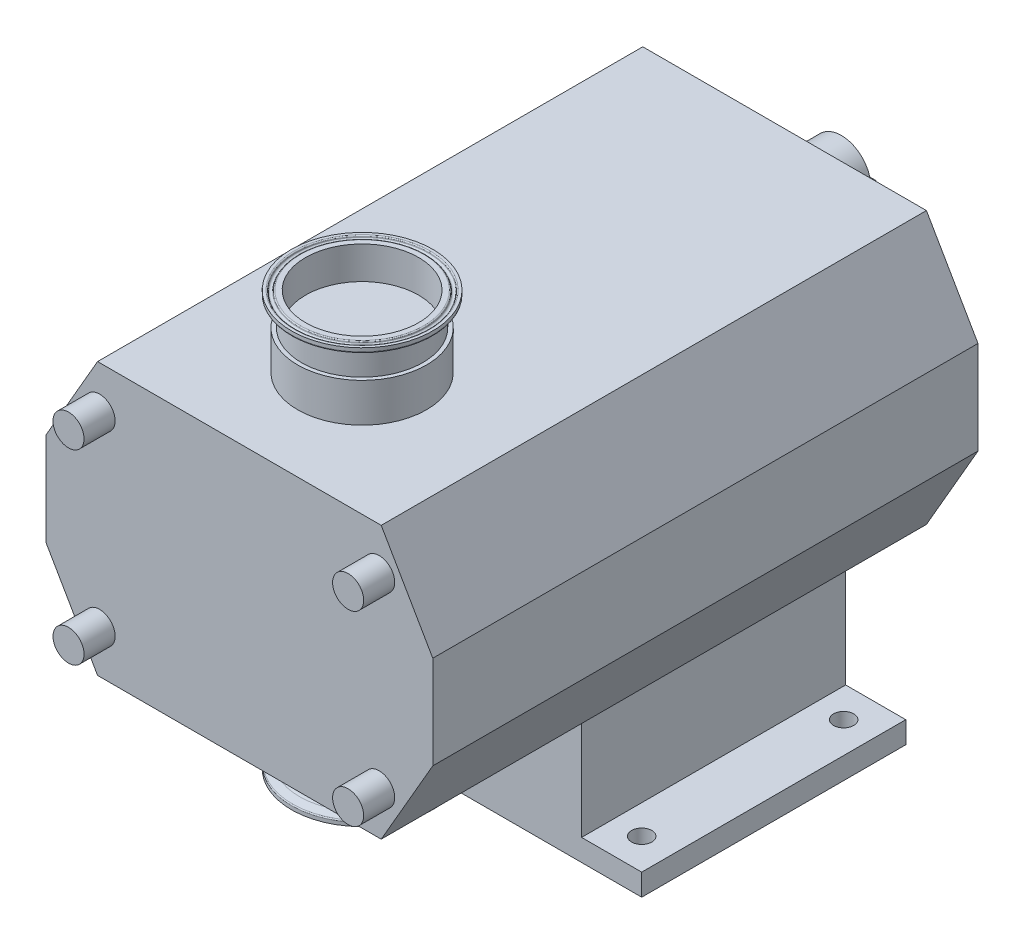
ISO-10303-21;
HEADER;
FILE_DESCRIPTION(('STEP AP214'),'2;1');
FILE_NAME('part.step','',(''),(''),'','','');
FILE_SCHEMA(('AUTOMOTIVE_DESIGN { 1 0 10303 214 1 1 1 1 }'));
ENDSEC;
DATA;
#1=APPLICATION_CONTEXT('core data for automotive mechanical design processes');
#2=APPLICATION_PROTOCOL_DEFINITION('international standard','automotive_design',2000,#1);
#3=PRODUCT_CONTEXT('',#1,'mechanical');
#4=PRODUCT('Part','Part','',(#3));
#5=PRODUCT_RELATED_PRODUCT_CATEGORY('part','',(#4));
#6=PRODUCT_DEFINITION_FORMATION('','',#4);
#7=PRODUCT_DEFINITION_CONTEXT('part definition',#1,'design');
#8=PRODUCT_DEFINITION('design','',#6,#7);
#9=PRODUCT_DEFINITION_SHAPE('','',#8);
#10=(LENGTH_UNIT() NAMED_UNIT(*) SI_UNIT(.MILLI.,.METRE.));
#11=(NAMED_UNIT(*) PLANE_ANGLE_UNIT() SI_UNIT($,.RADIAN.));
#12=(NAMED_UNIT(*) SI_UNIT($,.STERADIAN.) SOLID_ANGLE_UNIT());
#13=UNCERTAINTY_MEASURE_WITH_UNIT(LENGTH_MEASURE(1.E-05),#10,'distance_accuracy_value','');
#14=(GEOMETRIC_REPRESENTATION_CONTEXT(3) GLOBAL_UNCERTAINTY_ASSIGNED_CONTEXT((#13)) GLOBAL_UNIT_ASSIGNED_CONTEXT((#10,
#11,#12)) REPRESENTATION_CONTEXT('',''));
#15=CARTESIAN_POINT('',(0.,0.,0.));
#16=DIRECTION('',(0.,0.,1.));
#17=DIRECTION('',(1.,0.,0.));
#18=AXIS2_PLACEMENT_3D('',#15,#16,#17);
#19=CARTESIAN_POINT('',(-46.5,0.,241.732657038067));
#20=DIRECTION('',(0.,0.,1.));
#21=DIRECTION('',(1.,0.,0.));
#22=AXIS2_PLACEMENT_3D('',#19,#20,#21);
#23=CYLINDRICAL_SURFACE('',#22,19.);
#24=CARTESIAN_POINT('',(-46.5,0.,-3.));
#25=DIRECTION('',(0.,0.,1.));
#26=DIRECTION('',(1.,0.,0.));
#27=AXIS2_PLACEMENT_3D('',#24,#25,#26);
#28=CIRCLE('',#27,19.);
#29=CARTESIAN_POINT('',(-27.5,0.,-3.));
#30=VERTEX_POINT('',#29);
#31=EDGE_CURVE('P0_E277',#30,#30,#28,.T.);
#32=ORIENTED_EDGE('',*,*,#31,.F.);
#33=EDGE_LOOP('',(#32));
#34=FACE_BOUND('',#33,.T.);
#35=DIRECTION('',(0.,0.,1.));
#36=VECTOR('',#35,1.);
#37=CARTESIAN_POINT('',(-28.1696972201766,4.99999999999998,241.732657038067));
#38=LINE('',#37,#36);
#39=CARTESIAN_POINT('',(-28.1696972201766,5.,-83.));
#40=VERTEX_POINT('',#39);
#41=CARTESIAN_POINT('',(-28.1696972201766,5.,-43.));
#42=VERTEX_POINT('',#41);
#43=EDGE_CURVE('P0_E178',#40,#42,#38,.T.);
#44=ORIENTED_EDGE('',*,*,#43,.F.);
#45=CARTESIAN_POINT('',(-46.5,0.,-83.));
#46=DIRECTION('',(0.,0.,1.));
#47=DIRECTION('',(1.,0.,0.));
#48=AXIS2_PLACEMENT_3D('',#45,#46,#47);
#49=CIRCLE('',#48,19.);
#50=CARTESIAN_POINT('',(-28.1696972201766,-5.,-83.));
#51=VERTEX_POINT('',#50);
#52=EDGE_CURVE('P0_E176',#40,#51,#49,.T.);
#53=ORIENTED_EDGE('',*,*,#52,.T.);
#54=DIRECTION('',(0.,0.,1.));
#55=VECTOR('',#54,1.);
#56=CARTESIAN_POINT('',(-28.1696972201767,-5.00000000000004,241.732657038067));
#57=LINE('',#56,#55);
#58=CARTESIAN_POINT('',(-28.1696972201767,-5.00000000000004,-43.));
#59=VERTEX_POINT('',#58);
#60=EDGE_CURVE('P0_E39',#59,#51,#57,.F.);
#61=ORIENTED_EDGE('',*,*,#60,.F.);
#62=CARTESIAN_POINT('',(-27.5,0.,-48.));
#63=CARTESIAN_POINT('',(-27.5000042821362,0.275769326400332,-47.9999931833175));
#64=CARTESIAN_POINT('',(-27.5060630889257,0.551612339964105,-47.9771088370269));
#65=CARTESIAN_POINT('',(-27.5296447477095,1.09536084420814,-47.8863327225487));
#66=CARTESIAN_POINT('',(-27.5471733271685,1.36326229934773,-47.8184184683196));
#67=CARTESIAN_POINT('',(-27.5917584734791,1.88319959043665,-47.6399368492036));
#68=CARTESIAN_POINT('',(-27.6188029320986,2.13525511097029,-47.5294236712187));
#69=CARTESIAN_POINT('',(-27.6795569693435,2.61725305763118,-47.2690799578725));
#70=CARTESIAN_POINT('',(-27.7132669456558,2.84719416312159,-47.1192470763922));
#71=CARTESIAN_POINT('',(-27.7845611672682,3.28363987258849,-46.7809367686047));
#72=CARTESIAN_POINT('',(-27.8222102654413,3.48957269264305,-46.591735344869));
#73=CARTESIAN_POINT('',(-27.8967199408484,3.86718169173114,-46.1816068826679));
#74=CARTESIAN_POINT('',(-27.9335804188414,4.03885358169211,-45.9606758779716));
#75=CARTESIAN_POINT('',(-28.0030006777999,4.34583417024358,-45.4888224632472));
#76=CARTESIAN_POINT('',(-28.0354785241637,4.48048899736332,-45.237461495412));
#77=CARTESIAN_POINT('',(-28.0915043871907,4.7054029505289,-44.7146757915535));
#78=CARTESIAN_POINT('',(-28.1150540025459,4.79567002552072,-44.4432546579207));
#79=CARTESIAN_POINT('',(-28.1498881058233,4.92726790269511,-43.894376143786));
#80=CARTESIAN_POINT('',(-28.1614315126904,4.96963355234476,-43.6171837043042));
#81=CARTESIAN_POINT('',(-28.171720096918,5.00745164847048,-43.0594039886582));
#82=CARTESIAN_POINT('',(-28.1704675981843,5.00291261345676,-42.7788173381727));
#83=CARTESIAN_POINT('',(-28.1555378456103,4.9478726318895,-42.2302595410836));
#84=CARTESIAN_POINT('',(-28.1421979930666,4.89861973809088,-41.9621525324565));
#85=CARTESIAN_POINT('',(-28.1051362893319,4.75754734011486,-41.4381479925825));
#86=CARTESIAN_POINT('',(-28.0814136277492,4.6657245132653,-41.1822514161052));
#87=CARTESIAN_POINT('',(-28.0259597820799,4.4410917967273,-40.6866584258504));
#88=CARTESIAN_POINT('',(-27.9941431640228,4.30784106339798,-40.4471717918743));
#89=CARTESIAN_POINT('',(-27.926132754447,4.00444274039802,-39.9935172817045));
#90=CARTESIAN_POINT('',(-27.8899381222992,3.83428805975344,-39.7793542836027));
#91=CARTESIAN_POINT('',(-27.8158419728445,3.45551254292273,-39.3752910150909));
#92=CARTESIAN_POINT('',(-27.7779227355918,3.24584253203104,-39.1863761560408));
#93=CARTESIAN_POINT('',(-27.705680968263,2.79733618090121,-38.8461906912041));
#94=CARTESIAN_POINT('',(-27.671358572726,2.55849875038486,-38.6949214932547));
#95=CARTESIAN_POINT('',(-27.6099756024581,2.05693717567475,-38.4339031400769));
#96=CARTESIAN_POINT('',(-27.5829456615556,1.79411828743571,-38.3243283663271));
#97=CARTESIAN_POINT('',(-27.5394148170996,1.25291705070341,-38.151199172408));
#98=CARTESIAN_POINT('',(-27.5229116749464,0.974538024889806,-38.0876349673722));
#99=CARTESIAN_POINT('',(-27.5026308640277,0.418531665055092,-38.009869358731));
#100=CARTESIAN_POINT('',(-27.4985077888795,0.141104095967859,-37.9943277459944));
#101=CARTESIAN_POINT('',(-27.5024606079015,-0.412392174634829,-38.0093527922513));
#102=CARTESIAN_POINT('',(-27.5105352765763,-0.688461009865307,-38.0399148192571));
#103=CARTESIAN_POINT('',(-27.5377535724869,-1.22664703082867,-38.1451790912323));
#104=CARTESIAN_POINT('',(-27.5567105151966,-1.48892004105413,-38.2191373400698));
#105=CARTESIAN_POINT('',(-27.6035461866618,-1.99731390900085,-38.4082337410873));
#106=CARTESIAN_POINT('',(-27.6314258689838,-2.24343303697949,-38.5233762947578));
#107=CARTESIAN_POINT('',(-27.6938277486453,-2.71776721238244,-38.7940826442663));
#108=CARTESIAN_POINT('',(-27.7284672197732,-2.9455476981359,-38.9503801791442));
#109=CARTESIAN_POINT('',(-27.8003827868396,-3.3721194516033,-39.298034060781));
#110=CARTESIAN_POINT('',(-27.8376593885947,-3.5709051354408,-39.4893971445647));
#111=CARTESIAN_POINT('',(-27.9119129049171,-3.93946537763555,-39.9079980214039));
#112=CARTESIAN_POINT('',(-27.9488536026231,-4.10829545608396,-40.1360753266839));
#113=CARTESIAN_POINT('',(-28.0171260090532,-4.40530154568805,-40.6181009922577));
#114=CARTESIAN_POINT('',(-28.048457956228,-4.5334792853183,-40.8720482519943));
#115=CARTESIAN_POINT('',(-28.1016076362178,-4.74457728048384,-41.3973124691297));
#116=CARTESIAN_POINT('',(-28.1234807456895,-4.82776168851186,-41.6685173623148));
#117=CARTESIAN_POINT('',(-28.1552579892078,-4.94715371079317,-42.2217364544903));
#118=CARTESIAN_POINT('',(-28.1651650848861,-4.98337294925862,-42.5037479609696));
#119=CARTESIAN_POINT('',(-28.1716457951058,-5.00715081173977,-43.0609183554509));
#120=CARTESIAN_POINT('',(-28.1686348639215,-4.99622557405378,-43.3360086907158));
#121=CARTESIAN_POINT('',(-28.1505888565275,-4.92953140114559,-43.8802760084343));
#122=CARTESIAN_POINT('',(-28.1355540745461,-4.87376356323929,-44.1494531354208));
#123=CARTESIAN_POINT('',(-28.095398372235,-4.71983552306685,-44.6724009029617));
#124=CARTESIAN_POINT('',(-28.0703520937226,-4.6219886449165,-44.9262699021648));
#125=CARTESIAN_POINT('',(-28.012991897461,-4.38692411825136,-45.4141783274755));
#126=CARTESIAN_POINT('',(-27.9806768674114,-4.24970044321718,-45.648214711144));
#127=CARTESIAN_POINT('',(-27.9112611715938,-3.93514861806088,-46.0970708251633));
#128=CARTESIAN_POINT('',(-27.8740497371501,-3.7567820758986,-46.3111458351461));
#129=CARTESIAN_POINT('',(-27.7996615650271,-3.36699304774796,-46.7068188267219));
#130=CARTESIAN_POINT('',(-27.7624848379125,-3.15556257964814,-46.8884089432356));
#131=CARTESIAN_POINT('',(-27.6914364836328,-2.7003741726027,-47.2176404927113));
#132=CARTESIAN_POINT('',(-27.6576490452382,-2.45603841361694,-47.3645027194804));
#133=CARTESIAN_POINT('',(-27.5980996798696,-1.94526775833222,-47.6148349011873));
#134=CARTESIAN_POINT('',(-27.5723324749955,-1.67884754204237,-47.7183334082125));
#135=CARTESIAN_POINT('',(-27.5351625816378,-1.17775159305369,-47.8650961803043));
#136=CARTESIAN_POINT('',(-27.5220714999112,-0.945286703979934,-47.9155694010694));
#137=CARTESIAN_POINT('',(-27.5044887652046,-0.47523246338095,-47.9830226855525));
#138=CARTESIAN_POINT('',(-27.4999963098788,-0.237643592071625,-48.0000058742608));
#139=CARTESIAN_POINT('',(-27.5,0.,-48.));
#140=B_SPLINE_CURVE_WITH_KNOTS('',3,(#62,#63,#64,#65,#66,#67,#68,#69,#70,#71,#72,#73,#74,#75,
#76,#77,#78,#79,#80,#81,#82,#83,#84,#85,#86,#87,#88,#89,#90,#91,#92,#93,#94,#95,#96,#97,#98,#99,
#100,#101,#102,#103,#104,#105,#106,#107,#108,#109,#110,#111,#112,#113,#114,#115,#116,#117,#118,
#119,#120,#121,#122,#123,#124,#125,#126,#127,#128,#129,#130,#131,#132,#133,#134,#135,#136,#137,
#138,#139),.UNSPECIFIED.,.T.,.F.,(4,2,2,2,2,2,2,2,2,2,2,2,2,2,2,2,2,2,2,2,2,2,2,2,2,2,2,2,2,2,2,
2,2,2,2,2,2,2,4),(0.,0.826436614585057,1.65328622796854,2.47908752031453,3.30493809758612,
4.14758534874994,4.99033802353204,5.84713921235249,6.70378690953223,7.54155141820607,
8.37916378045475,9.19409222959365,10.0090842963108,10.8330642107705,11.6572025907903,
12.5074895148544,13.35780823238,14.2116451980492,15.0653005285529,15.8949065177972,
16.7244291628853,17.5401294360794,18.3559169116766,19.187369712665,20.0189824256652,
20.873388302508,21.7277578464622,22.577055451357,23.4261428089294,24.2481310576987,
25.0700991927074,25.8860500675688,26.702125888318,27.5416338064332,28.3813447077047,
29.2384104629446,30.0949110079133,30.8071573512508,31.5193372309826),.UNSPECIFIED.);
#141=EDGE_CURVE('P0_E11',#42,#59,#140,.T.);
#142=ORIENTED_EDGE('',*,*,#141,.F.);
#143=EDGE_LOOP('',(#44,#53,#61,#142));
#144=FACE_BOUND('',#143,.T.);
#145=ADVANCED_FACE('P0_F17',(#34,#144),#23,.T.);
#146=CARTESIAN_POINT('',(-91.3023595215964,-87.5,351.));
#147=DIRECTION('',(0.,1.,0.));
#148=DIRECTION('',(-1.,0.,0.));
#149=AXIS2_PLACEMENT_3D('',#146,#147,#148);
#150=PLANE('',#149);
#151=CARTESIAN_POINT('',(0.,-87.5,272.));
#152=DIRECTION('',(0.,1.,0.));
#153=DIRECTION('',(-1.,0.,0.));
#154=AXIS2_PLACEMENT_3D('',#151,#152,#153);
#155=CIRCLE('',#154,41.5);
#156=CARTESIAN_POINT('',(-41.5,-87.5,272.));
#157=VERTEX_POINT('',#156);
#158=EDGE_CURVE('P0_E192',#157,#157,#155,.T.);
#159=ORIENTED_EDGE('',*,*,#158,.T.);
#160=EDGE_LOOP('',(#159));
#161=FACE_BOUND('',#160,.T.);
#162=DIRECTION('',(1.,0.,0.));
#163=VECTOR('',#162,1.);
#164=CARTESIAN_POINT('',(-91.3023595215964,-87.5,0.));
#165=LINE('',#164,#163);
#166=CARTESIAN_POINT('',(-91.3023595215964,-87.5,0.));
#167=VERTEX_POINT('',#166);
#168=CARTESIAN_POINT('',(91.3023595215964,-87.5,0.));
#169=VERTEX_POINT('',#168);
#170=EDGE_CURVE('P0_E328',#167,#169,#165,.T.);
#171=ORIENTED_EDGE('',*,*,#170,.T.);
#172=DIRECTION('',(0.,0.,-1.));
#173=VECTOR('',#172,1.);
#174=CARTESIAN_POINT('',(91.3023595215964,-87.5,351.));
#175=LINE('',#174,#173);
#176=CARTESIAN_POINT('',(91.3023595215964,-87.5,351.));
#177=VERTEX_POINT('',#176);
#178=EDGE_CURVE('P0_E338',#177,#169,#175,.T.);
#179=ORIENTED_EDGE('',*,*,#178,.F.);
#180=DIRECTION('',(1.,0.,0.));
#181=VECTOR('',#180,1.);
#182=CARTESIAN_POINT('',(-91.3023595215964,-87.5,351.));
#183=LINE('',#182,#181);
#184=CARTESIAN_POINT('',(-91.3023595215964,-87.5,351.));
#185=VERTEX_POINT('',#184);
#186=EDGE_CURVE('P0_E311',#185,#177,#183,.T.);
#187=ORIENTED_EDGE('',*,*,#186,.F.);
#188=DIRECTION('',(0.,0.,-1.));
#189=VECTOR('',#188,1.);
#190=CARTESIAN_POINT('',(-91.3023595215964,-87.5,351.));
#191=LINE('',#190,#189);
#192=EDGE_CURVE('P0_E341',#185,#167,#191,.T.);
#193=ORIENTED_EDGE('',*,*,#192,.T.);
#194=EDGE_LOOP('',(#171,#179,#187,#193));
#195=FACE_BOUND('',#194,.T.);
#196=DIRECTION('',(1.,0.,0.));
#197=VECTOR('',#196,1.);
#198=CARTESIAN_POINT('',(66.3023595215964,-87.5,27.));
#199=LINE('',#198,#197);
#200=CARTESIAN_POINT('',(-66.3023595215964,-87.5,27.));
#201=VERTEX_POINT('',#200);
#202=CARTESIAN_POINT('',(66.3023595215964,-87.5,27.));
#203=VERTEX_POINT('',#202);
#204=EDGE_CURVE('P0_E220',#201,#203,#199,.T.);
#205=ORIENTED_EDGE('',*,*,#204,.F.);
#206=DIRECTION('',(0.,0.,1.));
#207=VECTOR('',#206,1.);
#208=CARTESIAN_POINT('',(-66.3023595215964,-87.5,27.));
#209=LINE('',#208,#207);
#210=CARTESIAN_POINT('',(-66.3023595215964,-87.5,197.));
#211=VERTEX_POINT('',#210);
#212=EDGE_CURVE('P0_E238',#201,#211,#209,.T.);
#213=ORIENTED_EDGE('',*,*,#212,.T.);
#214=DIRECTION('',(1.,0.,0.));
#215=VECTOR('',#214,1.);
#216=CARTESIAN_POINT('',(66.3023595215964,-87.5,197.));
#217=LINE('',#216,#215);
#218=CARTESIAN_POINT('',(66.3023595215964,-87.5,197.));
#219=VERTEX_POINT('',#218);
#220=EDGE_CURVE('P0_E219',#211,#219,#217,.T.);
#221=ORIENTED_EDGE('',*,*,#220,.T.);
#222=DIRECTION('',(0.,0.,1.));
#223=VECTOR('',#222,1.);
#224=CARTESIAN_POINT('',(66.3023595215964,-87.5,27.));
#225=LINE('',#224,#223);
#226=EDGE_CURVE('P0_E274',#203,#219,#225,.T.);
#227=ORIENTED_EDGE('',*,*,#226,.F.);
#228=EDGE_LOOP('',(#205,#213,#221,#227));
#229=FACE_BOUND('',#228,.T.);
#230=ADVANCED_FACE('P0_F393',(#161,#195,#229),#150,.F.);
#231=CARTESIAN_POINT('',(0.,245.640325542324,0.));
#232=DIRECTION('',(0.,0.,-1.));
#233=DIRECTION('',(-1.,0.,0.));
#234=AXIS2_PLACEMENT_3D('',#231,#232,#233);
#235=PLANE('',#234);
#236=DIRECTION('',(-0.500000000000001,0.866025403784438,0.));
#237=VECTOR('',#236,1.);
#238=CARTESIAN_POINT('',(91.3023595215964,87.5,0.));
#239=LINE('',#238,#237);
#240=CARTESIAN_POINT('',(124.5,30.,0.));
#241=VERTEX_POINT('',#240);
#242=CARTESIAN_POINT('',(91.3023595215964,87.5,0.));
#243=VERTEX_POINT('',#242);
#244=EDGE_CURVE('P0_E298',#241,#243,#239,.T.);
#245=ORIENTED_EDGE('',*,*,#244,.F.);
#246=DIRECTION('',(0.,1.,0.));
#247=VECTOR('',#246,1.);
#248=CARTESIAN_POINT('',(124.5,30.,0.));
#249=LINE('',#248,#247);
#250=CARTESIAN_POINT('',(124.5,-30.,0.));
#251=VERTEX_POINT('',#250);
#252=EDGE_CURVE('P0_E303',#251,#241,#249,.T.);
#253=ORIENTED_EDGE('',*,*,#252,.F.);
#254=DIRECTION('',(0.500000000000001,0.866025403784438,0.));
#255=VECTOR('',#254,1.);
#256=CARTESIAN_POINT('',(91.3023595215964,-87.5,0.));
#257=LINE('',#256,#255);
#258=EDGE_CURVE('P0_E330',#169,#251,#257,.T.);
#259=ORIENTED_EDGE('',*,*,#258,.F.);
#260=ORIENTED_EDGE('',*,*,#170,.F.);
#261=DIRECTION('',(0.500000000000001,-0.866025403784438,0.));
#262=VECTOR('',#261,1.);
#263=CARTESIAN_POINT('',(-91.3023595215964,-87.5,0.));
#264=LINE('',#263,#262);
#265=CARTESIAN_POINT('',(-124.5,-30.,0.));
#266=VERTEX_POINT('',#265);
#267=EDGE_CURVE('P0_E326',#266,#167,#264,.T.);
#268=ORIENTED_EDGE('',*,*,#267,.F.);
#269=DIRECTION('',(0.,-1.,0.));
#270=VECTOR('',#269,1.);
#271=CARTESIAN_POINT('',(-124.5,30.,0.));
#272=LINE('',#271,#270);
#273=CARTESIAN_POINT('',(-124.5,30.,0.));
#274=VERTEX_POINT('',#273);
#275=EDGE_CURVE('P0_E324',#274,#266,#272,.T.);
#276=ORIENTED_EDGE('',*,*,#275,.F.);
#277=DIRECTION('',(-0.500000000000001,-0.866025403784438,0.));
#278=VECTOR('',#277,1.);
#279=CARTESIAN_POINT('',(-91.3023595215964,87.5,0.));
#280=LINE('',#279,#278);
#281=CARTESIAN_POINT('',(-91.3023595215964,87.5,0.));
#282=VERTEX_POINT('',#281);
#283=EDGE_CURVE('P0_E322',#282,#274,#280,.T.);
#284=ORIENTED_EDGE('',*,*,#283,.F.);
#285=DIRECTION('',(-1.,0.,0.));
#286=VECTOR('',#285,1.);
#287=CARTESIAN_POINT('',(-91.3023595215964,87.5,0.));
#288=LINE('',#287,#286);
#289=EDGE_CURVE('P0_E320',#243,#282,#288,.T.);
#290=ORIENTED_EDGE('',*,*,#289,.F.);
#291=EDGE_LOOP('',(#245,#253,#259,#260,#268,#276,#284,#290));
#292=FACE_BOUND('',#291,.T.);
#293=CARTESIAN_POINT('',(-46.5,0.,0.));
#294=DIRECTION('',(0.,0.,1.));
#295=DIRECTION('',(1.,0.,0.));
#296=AXIS2_PLACEMENT_3D('',#293,#294,#295);
#297=CIRCLE('',#296,22.);
#298=CARTESIAN_POINT('',(-24.5,0.,0.));
#299=VERTEX_POINT('',#298);
#300=EDGE_CURVE('P0_E283',#299,#299,#297,.T.);
#301=ORIENTED_EDGE('',*,*,#300,.T.);
#302=EDGE_LOOP('',(#301));
#303=FACE_BOUND('',#302,.T.);
#304=ADVANCED_FACE('P0_F399',(#292,#303),#235,.T.);
#305=CARTESIAN_POINT('',(0.,245.640325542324,351.));
#306=DIRECTION('',(0.,0.,-1.));
#307=DIRECTION('',(-1.,0.,0.));
#308=AXIS2_PLACEMENT_3D('',#305,#306,#307);
#309=PLANE('',#308);
#310=CARTESIAN_POINT('',(90.,-60.,351.));
#311=DIRECTION('',(0.,0.,-1.));
#312=DIRECTION('',(-1.,0.,0.));
#313=AXIS2_PLACEMENT_3D('',#310,#311,#312);
#314=CIRCLE('',#313,9.99999999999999);
#315=CARTESIAN_POINT('',(80.,-60.,351.));
#316=VERTEX_POINT('',#315);
#317=EDGE_CURVE('P0_E362',#316,#316,#314,.F.);
#318=ORIENTED_EDGE('',*,*,#317,.F.);
#319=EDGE_LOOP('',(#318));
#320=FACE_BOUND('',#319,.T.);
#321=CARTESIAN_POINT('',(-90.,60.,351.));
#322=DIRECTION('',(0.,0.,-1.));
#323=DIRECTION('',(-1.,0.,0.));
#324=AXIS2_PLACEMENT_3D('',#321,#322,#323);
#325=CIRCLE('',#324,9.99999999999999);
#326=CARTESIAN_POINT('',(-100.,60.,351.));
#327=VERTEX_POINT('',#326);
#328=EDGE_CURVE('P0_E356',#327,#327,#325,.F.);
#329=ORIENTED_EDGE('',*,*,#328,.F.);
#330=EDGE_LOOP('',(#329));
#331=FACE_BOUND('',#330,.T.);
#332=DIRECTION('',(-0.500000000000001,0.866025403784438,0.));
#333=VECTOR('',#332,1.);
#334=CARTESIAN_POINT('',(91.3023595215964,87.5,351.));
#335=LINE('',#334,#333);
#336=CARTESIAN_POINT('',(124.5,30.,351.));
#337=VERTEX_POINT('',#336);
#338=CARTESIAN_POINT('',(91.3023595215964,87.5,351.));
#339=VERTEX_POINT('',#338);
#340=EDGE_CURVE('P0_E299',#337,#339,#335,.T.);
#341=ORIENTED_EDGE('',*,*,#340,.T.);
#342=DIRECTION('',(-1.,0.,0.));
#343=VECTOR('',#342,1.);
#344=CARTESIAN_POINT('',(-91.3023595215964,87.5,351.));
#345=LINE('',#344,#343);
#346=CARTESIAN_POINT('',(-91.3023595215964,87.5,351.));
#347=VERTEX_POINT('',#346);
#348=EDGE_CURVE('P0_E302',#339,#347,#345,.T.);
#349=ORIENTED_EDGE('',*,*,#348,.T.);
#350=DIRECTION('',(-0.500000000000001,-0.866025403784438,0.));
#351=VECTOR('',#350,1.);
#352=CARTESIAN_POINT('',(-91.3023595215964,87.5,351.));
#353=LINE('',#352,#351);
#354=CARTESIAN_POINT('',(-124.5,30.,351.));
#355=VERTEX_POINT('',#354);
#356=EDGE_CURVE('P0_E305',#347,#355,#353,.T.);
#357=ORIENTED_EDGE('',*,*,#356,.T.);
#358=DIRECTION('',(0.,-1.,0.));
#359=VECTOR('',#358,1.);
#360=CARTESIAN_POINT('',(-124.5,30.,351.));
#361=LINE('',#360,#359);
#362=CARTESIAN_POINT('',(-124.5,-30.,351.));
#363=VERTEX_POINT('',#362);
#364=EDGE_CURVE('P0_E307',#355,#363,#361,.T.);
#365=ORIENTED_EDGE('',*,*,#364,.T.);
#366=DIRECTION('',(0.500000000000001,-0.866025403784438,0.));
#367=VECTOR('',#366,1.);
#368=CARTESIAN_POINT('',(-91.3023595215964,-87.5,351.));
#369=LINE('',#368,#367);
#370=EDGE_CURVE('P0_E309',#363,#185,#369,.T.);
#371=ORIENTED_EDGE('',*,*,#370,.T.);
#372=ORIENTED_EDGE('',*,*,#186,.T.);
#373=DIRECTION('',(0.500000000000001,0.866025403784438,0.));
#374=VECTOR('',#373,1.);
#375=CARTESIAN_POINT('',(91.3023595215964,-87.5,351.));
#376=LINE('',#375,#374);
#377=CARTESIAN_POINT('',(124.5,-30.,351.));
#378=VERTEX_POINT('',#377);
#379=EDGE_CURVE('P0_E313',#177,#378,#376,.T.);
#380=ORIENTED_EDGE('',*,*,#379,.T.);
#381=DIRECTION('',(0.,1.,0.));
#382=VECTOR('',#381,1.);
#383=CARTESIAN_POINT('',(124.5,30.,351.));
#384=LINE('',#383,#382);
#385=EDGE_CURVE('P0_E315',#378,#337,#384,.T.);
#386=ORIENTED_EDGE('',*,*,#385,.T.);
#387=EDGE_LOOP('',(#341,#349,#357,#365,#371,#372,#380,#386));
#388=FACE_BOUND('',#387,.T.);
#389=CARTESIAN_POINT('',(90.,60.,351.));
#390=DIRECTION('',(0.,0.,-1.));
#391=DIRECTION('',(-1.,0.,0.));
#392=AXIS2_PLACEMENT_3D('',#389,#390,#391);
#393=CIRCLE('',#392,9.99999999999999);
#394=CARTESIAN_POINT('',(80.,60.,351.));
#395=VERTEX_POINT('',#394);
#396=EDGE_CURVE('P0_E359',#395,#395,#393,.F.);
#397=ORIENTED_EDGE('',*,*,#396,.F.);
#398=EDGE_LOOP('',(#397));
#399=FACE_BOUND('',#398,.T.);
#400=CARTESIAN_POINT('',(-90.,-60.,351.));
#401=DIRECTION('',(0.,0.,-1.));
#402=DIRECTION('',(-1.,0.,0.));
#403=AXIS2_PLACEMENT_3D('',#400,#401,#402);
#404=CIRCLE('',#403,9.99999999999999);
#405=CARTESIAN_POINT('',(-100.,-60.,351.));
#406=VERTEX_POINT('',#405);
#407=EDGE_CURVE('P0_E29',#406,#406,#404,.F.);
#408=ORIENTED_EDGE('',*,*,#407,.F.);
#409=EDGE_LOOP('',(#408));
#410=FACE_BOUND('',#409,.T.);
#411=ADVANCED_FACE('P0_F448',(#320,#331,#388,#399,#410),#309,.F.);
#412=CARTESIAN_POINT('',(91.3023595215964,87.5,351.));
#413=DIRECTION('',(-0.866025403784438,-0.500000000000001,0.));
#414=DIRECTION('',(0.500000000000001,-0.866025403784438,0.));
#415=AXIS2_PLACEMENT_3D('',#412,#413,#414);
#416=PLANE('',#415);
#417=ORIENTED_EDGE('',*,*,#244,.T.);
#418=DIRECTION('',(0.,0.,-1.));
#419=VECTOR('',#418,1.);
#420=CARTESIAN_POINT('',(91.3023595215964,87.5,351.));
#421=LINE('',#420,#419);
#422=EDGE_CURVE('P0_E353',#339,#243,#421,.T.);
#423=ORIENTED_EDGE('',*,*,#422,.F.);
#424=ORIENTED_EDGE('',*,*,#340,.F.);
#425=DIRECTION('',(0.,0.,-1.));
#426=VECTOR('',#425,1.);
#427=CARTESIAN_POINT('',(124.5,30.,351.));
#428=LINE('',#427,#426);
#429=EDGE_CURVE('P0_E317',#337,#241,#428,.T.);
#430=ORIENTED_EDGE('',*,*,#429,.T.);
#431=EDGE_LOOP('',(#417,#423,#424,#430));
#432=FACE_BOUND('',#431,.T.);
#433=ADVANCED_FACE('P0_F19',(#432),#416,.F.);
#434=CARTESIAN_POINT('',(-91.3023595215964,87.5,351.));
#435=DIRECTION('',(0.,-1.,0.));
#436=DIRECTION('',(1.,0.,0.));
#437=AXIS2_PLACEMENT_3D('',#434,#435,#436);
#438=PLANE('',#437);
#439=CARTESIAN_POINT('',(0.,87.5,272.));
#440=DIRECTION('',(0.,-1.,0.));
#441=DIRECTION('',(1.,0.,0.));
#442=AXIS2_PLACEMENT_3D('',#439,#440,#441);
#443=CIRCLE('',#442,41.5);
#444=CARTESIAN_POINT('',(41.5,87.5,272.));
#445=VERTEX_POINT('',#444);
#446=EDGE_CURVE('P0_E191',#445,#445,#443,.T.);
#447=ORIENTED_EDGE('',*,*,#446,.T.);
#448=EDGE_LOOP('',(#447));
#449=FACE_BOUND('',#448,.T.);
#450=ORIENTED_EDGE('',*,*,#289,.T.);
#451=DIRECTION('',(0.,0.,-1.));
#452=VECTOR('',#451,1.);
#453=CARTESIAN_POINT('',(-91.3023595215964,87.5,351.));
#454=LINE('',#453,#452);
#455=EDGE_CURVE('P0_E350',#347,#282,#454,.T.);
#456=ORIENTED_EDGE('',*,*,#455,.F.);
#457=ORIENTED_EDGE('',*,*,#348,.F.);
#458=ORIENTED_EDGE('',*,*,#422,.T.);
#459=EDGE_LOOP('',(#450,#456,#457,#458));
#460=FACE_BOUND('',#459,.T.);
#461=ADVANCED_FACE('P0_F369',(#449,#460),#438,.F.);
#462=CARTESIAN_POINT('',(-91.3023595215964,87.5,351.));
#463=DIRECTION('',(0.866025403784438,-0.500000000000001,0.));
#464=DIRECTION('',(0.500000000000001,0.866025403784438,0.));
#465=AXIS2_PLACEMENT_3D('',#462,#463,#464);
#466=PLANE('',#465);
#467=ORIENTED_EDGE('',*,*,#283,.T.);
#468=DIRECTION('',(0.,0.,-1.));
#469=VECTOR('',#468,1.);
#470=CARTESIAN_POINT('',(-124.5,30.,351.));
#471=LINE('',#470,#469);
#472=EDGE_CURVE('P0_E347',#355,#274,#471,.T.);
#473=ORIENTED_EDGE('',*,*,#472,.F.);
#474=ORIENTED_EDGE('',*,*,#356,.F.);
#475=ORIENTED_EDGE('',*,*,#455,.T.);
#476=EDGE_LOOP('',(#467,#473,#474,#475));
#477=FACE_BOUND('',#476,.T.);
#478=ADVANCED_FACE('P0_F469',(#477),#466,.F.);
#479=CARTESIAN_POINT('',(-124.5,30.,351.));
#480=DIRECTION('',(1.,0.,0.));
#481=DIRECTION('',(0.,0.,-1.));
#482=AXIS2_PLACEMENT_3D('',#479,#480,#481);
#483=PLANE('',#482);
#484=ORIENTED_EDGE('',*,*,#275,.T.);
#485=DIRECTION('',(0.,0.,-1.));
#486=VECTOR('',#485,1.);
#487=CARTESIAN_POINT('',(-124.5,-30.,351.));
#488=LINE('',#487,#486);
#489=EDGE_CURVE('P0_E344',#363,#266,#488,.T.);
#490=ORIENTED_EDGE('',*,*,#489,.F.);
#491=ORIENTED_EDGE('',*,*,#364,.F.);
#492=ORIENTED_EDGE('',*,*,#472,.T.);
#493=EDGE_LOOP('',(#484,#490,#491,#492));
#494=FACE_BOUND('',#493,.T.);
#495=ADVANCED_FACE('P0_F465',(#494),#483,.F.);
#496=CARTESIAN_POINT('',(-91.3023595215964,-87.5,351.));
#497=DIRECTION('',(0.866025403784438,0.500000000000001,0.));
#498=DIRECTION('',(-0.500000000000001,0.866025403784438,0.));
#499=AXIS2_PLACEMENT_3D('',#496,#497,#498);
#500=PLANE('',#499);
#501=ORIENTED_EDGE('',*,*,#267,.T.);
#502=ORIENTED_EDGE('',*,*,#192,.F.);
#503=ORIENTED_EDGE('',*,*,#370,.F.);
#504=ORIENTED_EDGE('',*,*,#489,.T.);
#505=EDGE_LOOP('',(#501,#502,#503,#504));
#506=FACE_BOUND('',#505,.T.);
#507=ADVANCED_FACE('P0_F460',(#506),#500,.F.);
#508=CARTESIAN_POINT('',(91.3023595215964,-87.5,351.));
#509=DIRECTION('',(-0.866025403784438,0.500000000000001,0.));
#510=DIRECTION('',(-0.500000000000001,-0.866025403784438,0.));
#511=AXIS2_PLACEMENT_3D('',#508,#509,#510);
#512=PLANE('',#511);
#513=ORIENTED_EDGE('',*,*,#258,.T.);
#514=DIRECTION('',(0.,0.,-1.));
#515=VECTOR('',#514,1.);
#516=CARTESIAN_POINT('',(124.5,-30.,351.));
#517=LINE('',#516,#515);
#518=EDGE_CURVE('P0_E335',#378,#251,#517,.T.);
#519=ORIENTED_EDGE('',*,*,#518,.F.);
#520=ORIENTED_EDGE('',*,*,#379,.F.);
#521=ORIENTED_EDGE('',*,*,#178,.T.);
#522=EDGE_LOOP('',(#513,#519,#520,#521));
#523=FACE_BOUND('',#522,.T.);
#524=ADVANCED_FACE('P0_F457',(#523),#512,.F.);
#525=CARTESIAN_POINT('',(124.5,30.,351.));
#526=DIRECTION('',(-1.,0.,0.));
#527=DIRECTION('',(0.,0.,1.));
#528=AXIS2_PLACEMENT_3D('',#525,#526,#527);
#529=PLANE('',#528);
#530=ORIENTED_EDGE('',*,*,#252,.T.);
#531=ORIENTED_EDGE('',*,*,#429,.F.);
#532=ORIENTED_EDGE('',*,*,#385,.F.);
#533=ORIENTED_EDGE('',*,*,#518,.T.);
#534=EDGE_LOOP('',(#530,#531,#532,#533));
#535=FACE_BOUND('',#534,.T.);
#536=ADVANCED_FACE('P0_F446',(#535),#529,.F.);
#537=CARTESIAN_POINT('',(-90.,60.,371.));
#538=DIRECTION('',(0.,0.,-1.));
#539=DIRECTION('',(-1.,0.,0.));
#540=AXIS2_PLACEMENT_3D('',#537,#538,#539);
#541=CYLINDRICAL_SURFACE('',#540,9.99999999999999);
#542=CARTESIAN_POINT('',(-90.,60.,371.));
#543=DIRECTION('',(0.,0.,1.));
#544=DIRECTION('',(1.,0.,0.));
#545=AXIS2_PLACEMENT_3D('',#542,#543,#544);
#546=CIRCLE('',#545,9.99999999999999);
#547=CARTESIAN_POINT('',(-80.,60.,371.));
#548=VERTEX_POINT('',#547);
#549=EDGE_CURVE('P0_E295',#548,#548,#546,.T.);
#550=ORIENTED_EDGE('',*,*,#549,.F.);
#551=EDGE_LOOP('',(#550));
#552=FACE_BOUND('',#551,.T.);
#553=ORIENTED_EDGE('',*,*,#328,.T.);
#554=EDGE_LOOP('',(#553));
#555=FACE_BOUND('',#554,.T.);
#556=ADVANCED_FACE('P0_F442',(#552,#555),#541,.T.);
#557=CARTESIAN_POINT('',(-90.,60.,371.));
#558=DIRECTION('',(0.,0.,1.));
#559=DIRECTION('',(1.,0.,0.));
#560=AXIS2_PLACEMENT_3D('',#557,#558,#559);
#561=PLANE('',#560);
#562=ORIENTED_EDGE('',*,*,#549,.T.);
#563=EDGE_LOOP('',(#562));
#564=FACE_BOUND('',#563,.T.);
#565=ADVANCED_FACE('P0_F438',(#564),#561,.T.);
#566=CARTESIAN_POINT('',(90.,60.,371.));
#567=DIRECTION('',(0.,0.,-1.));
#568=DIRECTION('',(-1.,0.,0.));
#569=AXIS2_PLACEMENT_3D('',#566,#567,#568);
#570=CYLINDRICAL_SURFACE('',#569,9.99999999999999);
#571=CARTESIAN_POINT('',(90.,60.,371.));
#572=DIRECTION('',(0.,0.,1.));
#573=DIRECTION('',(1.,0.,0.));
#574=AXIS2_PLACEMENT_3D('',#571,#572,#573);
#575=CIRCLE('',#574,9.99999999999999);
#576=CARTESIAN_POINT('',(100.,60.,371.));
#577=VERTEX_POINT('',#576);
#578=EDGE_CURVE('P0_E292',#577,#577,#575,.T.);
#579=ORIENTED_EDGE('',*,*,#578,.F.);
#580=EDGE_LOOP('',(#579));
#581=FACE_BOUND('',#580,.T.);
#582=ORIENTED_EDGE('',*,*,#396,.T.);
#583=EDGE_LOOP('',(#582));
#584=FACE_BOUND('',#583,.T.);
#585=ADVANCED_FACE('P0_F434',(#581,#584),#570,.T.);
#586=CARTESIAN_POINT('',(90.,60.,371.));
#587=DIRECTION('',(0.,0.,1.));
#588=DIRECTION('',(1.,0.,0.));
#589=AXIS2_PLACEMENT_3D('',#586,#587,#588);
#590=PLANE('',#589);
#591=ORIENTED_EDGE('',*,*,#578,.T.);
#592=EDGE_LOOP('',(#591));
#593=FACE_BOUND('',#592,.T.);
#594=ADVANCED_FACE('P0_F430',(#593),#590,.T.);
#595=CARTESIAN_POINT('',(90.,-60.,371.));
#596=DIRECTION('',(0.,0.,-1.));
#597=DIRECTION('',(-1.,0.,0.));
#598=AXIS2_PLACEMENT_3D('',#595,#596,#597);
#599=CYLINDRICAL_SURFACE('',#598,9.99999999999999);
#600=CARTESIAN_POINT('',(90.,-60.,371.));
#601=DIRECTION('',(0.,0.,1.));
#602=DIRECTION('',(1.,0.,0.));
#603=AXIS2_PLACEMENT_3D('',#600,#601,#602);
#604=CIRCLE('',#603,9.99999999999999);
#605=CARTESIAN_POINT('',(100.,-60.,371.));
#606=VERTEX_POINT('',#605);
#607=EDGE_CURVE('P0_E289',#606,#606,#604,.T.);
#608=ORIENTED_EDGE('',*,*,#607,.F.);
#609=EDGE_LOOP('',(#608));
#610=FACE_BOUND('',#609,.T.);
#611=ORIENTED_EDGE('',*,*,#317,.T.);
#612=EDGE_LOOP('',(#611));
#613=FACE_BOUND('',#612,.T.);
#614=ADVANCED_FACE('P0_F426',(#610,#613),#599,.T.);
#615=CARTESIAN_POINT('',(90.,-60.,371.));
#616=DIRECTION('',(0.,0.,1.));
#617=DIRECTION('',(1.,0.,0.));
#618=AXIS2_PLACEMENT_3D('',#615,#616,#617);
#619=PLANE('',#618);
#620=ORIENTED_EDGE('',*,*,#607,.T.);
#621=EDGE_LOOP('',(#620));
#622=FACE_BOUND('',#621,.T.);
#623=ADVANCED_FACE('P0_F422',(#622),#619,.T.);
#624=CARTESIAN_POINT('',(-90.,-60.,371.));
#625=DIRECTION('',(0.,0.,-1.));
#626=DIRECTION('',(-1.,0.,0.));
#627=AXIS2_PLACEMENT_3D('',#624,#625,#626);
#628=CYLINDRICAL_SURFACE('',#627,9.99999999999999);
#629=CARTESIAN_POINT('',(-90.,-60.,371.));
#630=DIRECTION('',(0.,0.,1.));
#631=DIRECTION('',(1.,0.,0.));
#632=AXIS2_PLACEMENT_3D('',#629,#630,#631);
#633=CIRCLE('',#632,9.99999999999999);
#634=CARTESIAN_POINT('',(-80.,-60.,371.));
#635=VERTEX_POINT('',#634);
#636=EDGE_CURVE('P0_E286',#635,#635,#633,.T.);
#637=ORIENTED_EDGE('',*,*,#636,.F.);
#638=EDGE_LOOP('',(#637));
#639=FACE_BOUND('',#638,.T.);
#640=ORIENTED_EDGE('',*,*,#407,.T.);
#641=EDGE_LOOP('',(#640));
#642=FACE_BOUND('',#641,.T.);
#643=ADVANCED_FACE('P0_F418',(#639,#642),#628,.T.);
#644=CARTESIAN_POINT('',(-90.,-60.,371.));
#645=DIRECTION('',(0.,0.,1.));
#646=DIRECTION('',(1.,0.,0.));
#647=AXIS2_PLACEMENT_3D('',#644,#645,#646);
#648=PLANE('',#647);
#649=ORIENTED_EDGE('',*,*,#636,.T.);
#650=EDGE_LOOP('',(#649));
#651=FACE_BOUND('',#650,.T.);
#652=ADVANCED_FACE('P0_F414',(#651),#648,.T.);
#653=CARTESIAN_POINT('',(-46.5,0.,241.732657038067));
#654=DIRECTION('',(0.,0.,1.));
#655=DIRECTION('',(1.,0.,0.));
#656=AXIS2_PLACEMENT_3D('',#653,#654,#655);
#657=CYLINDRICAL_SURFACE('',#656,22.);
#658=ORIENTED_EDGE('',*,*,#300,.F.);
#659=EDGE_LOOP('',(#658));
#660=FACE_BOUND('',#659,.T.);
#661=CARTESIAN_POINT('',(-46.5,0.,-3.));
#662=DIRECTION('',(0.,0.,1.));
#663=DIRECTION('',(1.,0.,0.));
#664=AXIS2_PLACEMENT_3D('',#661,#662,#663);
#665=CIRCLE('',#664,22.);
#666=CARTESIAN_POINT('',(-24.5,0.,-3.));
#667=VERTEX_POINT('',#666);
#668=EDGE_CURVE('P0_E280',#667,#667,#665,.T.);
#669=ORIENTED_EDGE('',*,*,#668,.T.);
#670=EDGE_LOOP('',(#669));
#671=FACE_BOUND('',#670,.T.);
#672=ADVANCED_FACE('P0_F410',(#660,#671),#657,.T.);
#673=CARTESIAN_POINT('',(-46.5,22.,-3.));
#674=DIRECTION('',(0.,0.,1.));
#675=DIRECTION('',(1.,0.,0.));
#676=AXIS2_PLACEMENT_3D('',#673,#674,#675);
#677=PLANE('',#676);
#678=ORIENTED_EDGE('',*,*,#668,.F.);
#679=EDGE_LOOP('',(#678));
#680=FACE_BOUND('',#679,.T.);
#681=ORIENTED_EDGE('',*,*,#31,.T.);
#682=EDGE_LOOP('',(#681));
#683=FACE_BOUND('',#682,.T.);
#684=ADVANCED_FACE('P0_F407',(#680,#683),#677,.F.);
#685=CARTESIAN_POINT('',(-46.5,19.,-83.));
#686=DIRECTION('',(0.,0.,1.));
#687=DIRECTION('',(1.,0.,0.));
#688=AXIS2_PLACEMENT_3D('',#685,#686,#687);
#689=PLANE('',#688);
#690=ORIENTED_EDGE('',*,*,#52,.F.);
#691=DIRECTION('',(-1.,0.,0.));
#692=VECTOR('',#691,1.);
#693=CARTESIAN_POINT('',(-24.1,5.,-83.));
#694=LINE('',#693,#692);
#695=CARTESIAN_POINT('',(-24.1,5.,-83.));
#696=VERTEX_POINT('',#695);
#697=EDGE_CURVE('P0_E158',#696,#40,#694,.T.);
#698=ORIENTED_EDGE('',*,*,#697,.F.);
#699=DIRECTION('',(0.,1.,0.));
#700=VECTOR('',#699,1.);
#701=CARTESIAN_POINT('',(-24.1,5.,-83.));
#702=LINE('',#701,#700);
#703=CARTESIAN_POINT('',(-24.1,-5.,-83.));
#704=VERTEX_POINT('',#703);
#705=EDGE_CURVE('P0_E164',#704,#696,#702,.T.);
#706=ORIENTED_EDGE('',*,*,#705,.F.);
#707=DIRECTION('',(-1.,0.,0.));
#708=VECTOR('',#707,1.);
#709=CARTESIAN_POINT('',(-24.1,-5.,-83.));
#710=LINE('',#709,#708);
#711=EDGE_CURVE('P0_E768',#704,#51,#710,.T.);
#712=ORIENTED_EDGE('',*,*,#711,.T.);
#713=EDGE_LOOP('',(#690,#698,#706,#712));
#714=FACE_BOUND('',#713,.T.);
#715=ADVANCED_FACE('P0_F175',(#714),#689,.F.);
#716=CARTESIAN_POINT('',(66.3023595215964,-87.5,27.));
#717=DIRECTION('',(-1.,0.,0.));
#718=DIRECTION('',(0.,-1.,0.));
#719=AXIS2_PLACEMENT_3D('',#716,#717,#718);
#720=PLANE('',#719);
#721=DIRECTION('',(0.,-1.,0.));
#722=VECTOR('',#721,1.);
#723=CARTESIAN_POINT('',(66.3023595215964,-87.5,197.));
#724=LINE('',#723,#722);
#725=CARTESIAN_POINT('',(66.3023595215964,-176.,197.));
#726=VERTEX_POINT('',#725);
#727=EDGE_CURVE('P0_E241',#219,#726,#724,.T.);
#728=ORIENTED_EDGE('',*,*,#727,.T.);
#729=DIRECTION('',(0.,0.,1.));
#730=VECTOR('',#729,1.);
#731=CARTESIAN_POINT('',(66.3023595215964,-176.,27.));
#732=LINE('',#731,#730);
#733=CARTESIAN_POINT('',(66.3023595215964,-176.,27.));
#734=VERTEX_POINT('',#733);
#735=EDGE_CURVE('P0_E271',#734,#726,#732,.T.);
#736=ORIENTED_EDGE('',*,*,#735,.F.);
#737=DIRECTION('',(0.,-1.,0.));
#738=VECTOR('',#737,1.);
#739=CARTESIAN_POINT('',(66.3023595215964,-87.5,27.));
#740=LINE('',#739,#738);
#741=EDGE_CURVE('P0_E223',#203,#734,#740,.T.);
#742=ORIENTED_EDGE('',*,*,#741,.F.);
#743=ORIENTED_EDGE('',*,*,#226,.T.);
#744=EDGE_LOOP('',(#728,#736,#742,#743));
#745=FACE_BOUND('',#744,.T.);
#746=ADVANCED_FACE('P0_F529',(#745),#720,.F.);
#747=CARTESIAN_POINT('',(66.3023595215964,-176.,27.));
#748=DIRECTION('',(0.,-1.,0.));
#749=DIRECTION('',(0.,0.,-1.));
#750=AXIS2_PLACEMENT_3D('',#747,#748,#749);
#751=PLANE('',#750);
#752=CARTESIAN_POINT('',(85.,-176.,47.));
#753=DIRECTION('',(0.,-1.,0.));
#754=DIRECTION('',(0.,0.,-1.));
#755=AXIS2_PLACEMENT_3D('',#752,#753,#754);
#756=CIRCLE('',#755,6.5);
#757=CARTESIAN_POINT('',(85.,-176.,40.5));
#758=VERTEX_POINT('',#757);
#759=EDGE_CURVE('P0_E207',#758,#758,#756,.F.);
#760=ORIENTED_EDGE('',*,*,#759,.F.);
#761=EDGE_LOOP('',(#760));
#762=FACE_BOUND('',#761,.T.);
#763=CARTESIAN_POINT('',(85.,-176.,177.));
#764=DIRECTION('',(0.,-1.,0.));
#765=DIRECTION('',(0.,0.,-1.));
#766=AXIS2_PLACEMENT_3D('',#763,#764,#765);
#767=CIRCLE('',#766,6.5);
#768=CARTESIAN_POINT('',(85.,-176.,170.5));
#769=VERTEX_POINT('',#768);
#770=EDGE_CURVE('P0_E213',#769,#769,#767,.F.);
#771=ORIENTED_EDGE('',*,*,#770,.F.);
#772=EDGE_LOOP('',(#771));
#773=FACE_BOUND('',#772,.T.);
#774=DIRECTION('',(1.,0.,0.));
#775=VECTOR('',#774,1.);
#776=CARTESIAN_POINT('',(66.3023595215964,-176.,197.));
#777=LINE('',#776,#775);
#778=CARTESIAN_POINT('',(105.,-176.,197.));
#779=VERTEX_POINT('',#778);
#780=EDGE_CURVE('P0_E243',#726,#779,#777,.T.);
#781=ORIENTED_EDGE('',*,*,#780,.T.);
#782=DIRECTION('',(0.,0.,1.));
#783=VECTOR('',#782,1.);
#784=CARTESIAN_POINT('',(105.,-176.,27.));
#785=LINE('',#784,#783);
#786=CARTESIAN_POINT('',(105.,-176.,27.));
#787=VERTEX_POINT('',#786);
#788=EDGE_CURVE('P0_E268',#787,#779,#785,.T.);
#789=ORIENTED_EDGE('',*,*,#788,.F.);
#790=DIRECTION('',(1.,0.,0.));
#791=VECTOR('',#790,1.);
#792=CARTESIAN_POINT('',(66.3023595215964,-176.,27.));
#793=LINE('',#792,#791);
#794=EDGE_CURVE('P0_E226',#734,#787,#793,.T.);
#795=ORIENTED_EDGE('',*,*,#794,.F.);
#796=ORIENTED_EDGE('',*,*,#735,.T.);
#797=EDGE_LOOP('',(#781,#789,#795,#796));
#798=FACE_BOUND('',#797,.T.);
#799=ADVANCED_FACE('P0_F532',(#762,#773,#798),#751,.F.);
#800=CARTESIAN_POINT('',(105.,-176.,27.));
#801=DIRECTION('',(-1.,0.,0.));
#802=DIRECTION('',(0.,-1.,0.));
#803=AXIS2_PLACEMENT_3D('',#800,#801,#802);
#804=PLANE('',#803);
#805=DIRECTION('',(0.,-1.,0.));
#806=VECTOR('',#805,1.);
#807=CARTESIAN_POINT('',(105.,-176.,197.));
#808=LINE('',#807,#806);
#809=CARTESIAN_POINT('',(105.,-190.,197.));
#810=VERTEX_POINT('',#809);
#811=EDGE_CURVE('P0_E245',#779,#810,#808,.T.);
#812=ORIENTED_EDGE('',*,*,#811,.T.);
#813=DIRECTION('',(0.,0.,1.));
#814=VECTOR('',#813,1.);
#815=CARTESIAN_POINT('',(105.,-190.,27.));
#816=LINE('',#815,#814);
#817=CARTESIAN_POINT('',(105.,-190.,27.));
#818=VERTEX_POINT('',#817);
#819=EDGE_CURVE('P0_E265',#818,#810,#816,.T.);
#820=ORIENTED_EDGE('',*,*,#819,.F.);
#821=DIRECTION('',(0.,-1.,0.));
#822=VECTOR('',#821,1.);
#823=CARTESIAN_POINT('',(105.,-176.,27.));
#824=LINE('',#823,#822);
#825=EDGE_CURVE('P0_E228',#787,#818,#824,.T.);
#826=ORIENTED_EDGE('',*,*,#825,.F.);
#827=ORIENTED_EDGE('',*,*,#788,.T.);
#828=EDGE_LOOP('',(#812,#820,#826,#827));
#829=FACE_BOUND('',#828,.T.);
#830=ADVANCED_FACE('P0_F539',(#829),#804,.F.);
#831=CARTESIAN_POINT('',(105.,-190.,27.));
#832=DIRECTION('',(0.,1.,0.));
#833=DIRECTION('',(-1.,0.,0.));
#834=AXIS2_PLACEMENT_3D('',#831,#832,#833);
#835=PLANE('',#834);
#836=CARTESIAN_POINT('',(-85.,-190.,177.));
#837=DIRECTION('',(0.,-1.,0.));
#838=DIRECTION('',(1.,0.,0.));
#839=AXIS2_PLACEMENT_3D('',#836,#837,#838);
#840=CIRCLE('',#839,6.5);
#841=CARTESIAN_POINT('',(-78.5,-190.,177.));
#842=VERTEX_POINT('',#841);
#843=EDGE_CURVE('P0_E198',#842,#842,#840,.T.);
#844=ORIENTED_EDGE('',*,*,#843,.F.);
#845=EDGE_LOOP('',(#844));
#846=FACE_BOUND('',#845,.T.);
#847=CARTESIAN_POINT('',(-85.,-190.,47.));
#848=DIRECTION('',(0.,-1.,0.));
#849=DIRECTION('',(1.,0.,0.));
#850=AXIS2_PLACEMENT_3D('',#847,#848,#849);
#851=CIRCLE('',#850,6.5);
#852=CARTESIAN_POINT('',(-78.5,-190.,47.));
#853=VERTEX_POINT('',#852);
#854=EDGE_CURVE('P0_E204',#853,#853,#851,.T.);
#855=ORIENTED_EDGE('',*,*,#854,.F.);
#856=EDGE_LOOP('',(#855));
#857=FACE_BOUND('',#856,.T.);
#858=CARTESIAN_POINT('',(85.,-190.,47.));
#859=DIRECTION('',(0.,-1.,0.));
#860=DIRECTION('',(1.,0.,0.));
#861=AXIS2_PLACEMENT_3D('',#858,#859,#860);
#862=CIRCLE('',#861,6.5);
#863=CARTESIAN_POINT('',(91.5,-190.,47.));
#864=VERTEX_POINT('',#863);
#865=EDGE_CURVE('P0_E210',#864,#864,#862,.T.);
#866=ORIENTED_EDGE('',*,*,#865,.F.);
#867=EDGE_LOOP('',(#866));
#868=FACE_BOUND('',#867,.T.);
#869=CARTESIAN_POINT('',(85.,-190.,177.));
#870=DIRECTION('',(0.,-1.,0.));
#871=DIRECTION('',(1.,0.,0.));
#872=AXIS2_PLACEMENT_3D('',#869,#870,#871);
#873=CIRCLE('',#872,6.5);
#874=CARTESIAN_POINT('',(91.5,-190.,177.));
#875=VERTEX_POINT('',#874);
#876=EDGE_CURVE('P0_E216',#875,#875,#873,.T.);
#877=ORIENTED_EDGE('',*,*,#876,.F.);
#878=EDGE_LOOP('',(#877));
#879=FACE_BOUND('',#878,.T.);
#880=DIRECTION('',(-1.,0.,0.));
#881=VECTOR('',#880,1.);
#882=CARTESIAN_POINT('',(105.,-190.,197.));
#883=LINE('',#882,#881);
#884=CARTESIAN_POINT('',(-105.,-190.,197.));
#885=VERTEX_POINT('',#884);
#886=EDGE_CURVE('P0_E247',#810,#885,#883,.T.);
#887=ORIENTED_EDGE('',*,*,#886,.T.);
#888=DIRECTION('',(0.,0.,1.));
#889=VECTOR('',#888,1.);
#890=CARTESIAN_POINT('',(-105.,-190.,27.));
#891=LINE('',#890,#889);
#892=CARTESIAN_POINT('',(-105.,-190.,27.));
#893=VERTEX_POINT('',#892);
#894=EDGE_CURVE('P0_E262',#893,#885,#891,.T.);
#895=ORIENTED_EDGE('',*,*,#894,.F.);
#896=DIRECTION('',(-1.,0.,0.));
#897=VECTOR('',#896,1.);
#898=CARTESIAN_POINT('',(105.,-190.,27.));
#899=LINE('',#898,#897);
#900=EDGE_CURVE('P0_E230',#818,#893,#899,.T.);
#901=ORIENTED_EDGE('',*,*,#900,.F.);
#902=ORIENTED_EDGE('',*,*,#819,.T.);
#903=EDGE_LOOP('',(#887,#895,#901,#902));
#904=FACE_BOUND('',#903,.T.);
#905=ADVANCED_FACE('P0_F542',(#846,#857,#868,#879,#904),#835,.F.);
#906=CARTESIAN_POINT('',(-105.,-176.,27.));
#907=DIRECTION('',(1.,0.,0.));
#908=DIRECTION('',(0.,1.,0.));
#909=AXIS2_PLACEMENT_3D('',#906,#907,#908);
#910=PLANE('',#909);
#911=DIRECTION('',(0.,1.,0.));
#912=VECTOR('',#911,1.);
#913=CARTESIAN_POINT('',(-105.,-176.,197.));
#914=LINE('',#913,#912);
#915=CARTESIAN_POINT('',(-105.,-176.,197.));
#916=VERTEX_POINT('',#915);
#917=EDGE_CURVE('P0_E249',#885,#916,#914,.T.);
#918=ORIENTED_EDGE('',*,*,#917,.T.);
#919=DIRECTION('',(0.,0.,1.));
#920=VECTOR('',#919,1.);
#921=CARTESIAN_POINT('',(-105.,-176.,27.));
#922=LINE('',#921,#920);
#923=CARTESIAN_POINT('',(-105.,-176.,27.));
#924=VERTEX_POINT('',#923);
#925=EDGE_CURVE('P0_E259',#924,#916,#922,.T.);
#926=ORIENTED_EDGE('',*,*,#925,.F.);
#927=DIRECTION('',(0.,1.,0.));
#928=VECTOR('',#927,1.);
#929=CARTESIAN_POINT('',(-105.,-176.,27.));
#930=LINE('',#929,#928);
#931=EDGE_CURVE('P0_E232',#893,#924,#930,.T.);
#932=ORIENTED_EDGE('',*,*,#931,.F.);
#933=ORIENTED_EDGE('',*,*,#894,.T.);
#934=EDGE_LOOP('',(#918,#926,#932,#933));
#935=FACE_BOUND('',#934,.T.);
#936=ADVANCED_FACE('P0_F547',(#935),#910,.F.);
#937=CARTESIAN_POINT('',(-66.3023595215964,-176.,27.));
#938=DIRECTION('',(0.,-1.,0.));
#939=DIRECTION('',(0.,0.,-1.));
#940=AXIS2_PLACEMENT_3D('',#937,#938,#939);
#941=PLANE('',#940);
#942=CARTESIAN_POINT('',(-85.,-176.,177.));
#943=DIRECTION('',(0.,-1.,0.));
#944=DIRECTION('',(0.,0.,-1.));
#945=AXIS2_PLACEMENT_3D('',#942,#943,#944);
#946=CIRCLE('',#945,6.5);
#947=CARTESIAN_POINT('',(-85.,-176.,170.5));
#948=VERTEX_POINT('',#947);
#949=EDGE_CURVE('P0_E195',#948,#948,#946,.F.);
#950=ORIENTED_EDGE('',*,*,#949,.F.);
#951=EDGE_LOOP('',(#950));
#952=FACE_BOUND('',#951,.T.);
#953=CARTESIAN_POINT('',(-85.,-176.,47.));
#954=DIRECTION('',(0.,-1.,0.));
#955=DIRECTION('',(0.,0.,-1.));
#956=AXIS2_PLACEMENT_3D('',#953,#954,#955);
#957=CIRCLE('',#956,6.5);
#958=CARTESIAN_POINT('',(-85.,-176.,40.5));
#959=VERTEX_POINT('',#958);
#960=EDGE_CURVE('P0_E201',#959,#959,#957,.F.);
#961=ORIENTED_EDGE('',*,*,#960,.F.);
#962=EDGE_LOOP('',(#961));
#963=FACE_BOUND('',#962,.T.);
#964=DIRECTION('',(1.,0.,0.));
#965=VECTOR('',#964,1.);
#966=CARTESIAN_POINT('',(-66.3023595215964,-176.,197.));
#967=LINE('',#966,#965);
#968=CARTESIAN_POINT('',(-66.3023595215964,-176.,197.));
#969=VERTEX_POINT('',#968);
#970=EDGE_CURVE('P0_E251',#916,#969,#967,.T.);
#971=ORIENTED_EDGE('',*,*,#970,.T.);
#972=DIRECTION('',(0.,0.,1.));
#973=VECTOR('',#972,1.);
#974=CARTESIAN_POINT('',(-66.3023595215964,-176.,27.));
#975=LINE('',#974,#973);
#976=CARTESIAN_POINT('',(-66.3023595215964,-176.,27.));
#977=VERTEX_POINT('',#976);
#978=EDGE_CURVE('P0_E256',#977,#969,#975,.T.);
#979=ORIENTED_EDGE('',*,*,#978,.F.);
#980=DIRECTION('',(1.,0.,0.));
#981=VECTOR('',#980,1.);
#982=CARTESIAN_POINT('',(-66.3023595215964,-176.,27.));
#983=LINE('',#982,#981);
#984=EDGE_CURVE('P0_E234',#924,#977,#983,.T.);
#985=ORIENTED_EDGE('',*,*,#984,.F.);
#986=ORIENTED_EDGE('',*,*,#925,.T.);
#987=EDGE_LOOP('',(#971,#979,#985,#986));
#988=FACE_BOUND('',#987,.T.);
#989=ADVANCED_FACE('P0_F549',(#952,#963,#988),#941,.F.);
#990=CARTESIAN_POINT('',(-66.3023595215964,-87.5,27.));
#991=DIRECTION('',(1.,0.,0.));
#992=DIRECTION('',(0.,1.,0.));
#993=AXIS2_PLACEMENT_3D('',#990,#991,#992);
#994=PLANE('',#993);
#995=DIRECTION('',(0.,1.,0.));
#996=VECTOR('',#995,1.);
#997=CARTESIAN_POINT('',(-66.3023595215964,-87.5,197.));
#998=LINE('',#997,#996);
#999=EDGE_CURVE('P0_E224',#969,#211,#998,.T.);
#1000=ORIENTED_EDGE('',*,*,#999,.T.);
#1001=ORIENTED_EDGE('',*,*,#212,.F.);
#1002=DIRECTION('',(0.,1.,0.));
#1003=VECTOR('',#1002,1.);
#1004=CARTESIAN_POINT('',(-66.3023595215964,-87.5,27.));
#1005=LINE('',#1004,#1003);
#1006=EDGE_CURVE('P0_E236',#977,#201,#1005,.T.);
#1007=ORIENTED_EDGE('',*,*,#1006,.F.);
#1008=ORIENTED_EDGE('',*,*,#978,.T.);
#1009=EDGE_LOOP('',(#1000,#1001,#1007,#1008));
#1010=FACE_BOUND('',#1009,.T.);
#1011=ADVANCED_FACE('P0_F519',(#1010),#994,.F.);
#1012=CARTESIAN_POINT('',(66.3023595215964,-87.5,27.));
#1013=DIRECTION('',(0.,0.,1.));
#1014=DIRECTION('',(1.,0.,0.));
#1015=AXIS2_PLACEMENT_3D('',#1012,#1013,#1014);
#1016=PLANE('',#1015);
#1017=ORIENTED_EDGE('',*,*,#204,.T.);
#1018=ORIENTED_EDGE('',*,*,#741,.T.);
#1019=ORIENTED_EDGE('',*,*,#794,.T.);
#1020=ORIENTED_EDGE('',*,*,#825,.T.);
#1021=ORIENTED_EDGE('',*,*,#900,.T.);
#1022=ORIENTED_EDGE('',*,*,#931,.T.);
#1023=ORIENTED_EDGE('',*,*,#984,.T.);
#1024=ORIENTED_EDGE('',*,*,#1006,.T.);
#1025=EDGE_LOOP('',(#1017,#1018,#1019,#1020,#1021,#1022,#1023,#1024));
#1026=FACE_BOUND('',#1025,.T.);
#1027=ADVANCED_FACE('P0_F513',(#1026),#1016,.F.);
#1028=CARTESIAN_POINT('',(66.3023595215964,-87.5,197.));
#1029=DIRECTION('',(0.,0.,1.));
#1030=DIRECTION('',(1.,0.,0.));
#1031=AXIS2_PLACEMENT_3D('',#1028,#1029,#1030);
#1032=PLANE('',#1031);
#1033=ORIENTED_EDGE('',*,*,#220,.F.);
#1034=ORIENTED_EDGE('',*,*,#999,.F.);
#1035=ORIENTED_EDGE('',*,*,#970,.F.);
#1036=ORIENTED_EDGE('',*,*,#917,.F.);
#1037=ORIENTED_EDGE('',*,*,#886,.F.);
#1038=ORIENTED_EDGE('',*,*,#811,.F.);
#1039=ORIENTED_EDGE('',*,*,#780,.F.);
#1040=ORIENTED_EDGE('',*,*,#727,.F.);
#1041=EDGE_LOOP('',(#1033,#1034,#1035,#1036,#1037,#1038,#1039,#1040));
#1042=FACE_BOUND('',#1041,.T.);
#1043=ADVANCED_FACE('P0_F525',(#1042),#1032,.T.);
#1044=CARTESIAN_POINT('',(85.,87.501,177.));
#1045=DIRECTION('',(0.,-1.,0.));
#1046=DIRECTION('',(1.,0.,0.));
#1047=AXIS2_PLACEMENT_3D('',#1044,#1045,#1046);
#1048=CYLINDRICAL_SURFACE('',#1047,6.5);
#1049=ORIENTED_EDGE('',*,*,#876,.T.);
#1050=EDGE_LOOP('',(#1049));
#1051=FACE_BOUND('',#1050,.T.);
#1052=ORIENTED_EDGE('',*,*,#770,.T.);
#1053=EDGE_LOOP('',(#1052));
#1054=FACE_BOUND('',#1053,.T.);
#1055=ADVANCED_FACE('P0_F684',(#1051,#1054),#1048,.F.);
#1056=CARTESIAN_POINT('',(85.,87.501,47.));
#1057=DIRECTION('',(0.,-1.,0.));
#1058=DIRECTION('',(1.,0.,0.));
#1059=AXIS2_PLACEMENT_3D('',#1056,#1057,#1058);
#1060=CYLINDRICAL_SURFACE('',#1059,6.5);
#1061=ORIENTED_EDGE('',*,*,#865,.T.);
#1062=EDGE_LOOP('',(#1061));
#1063=FACE_BOUND('',#1062,.T.);
#1064=ORIENTED_EDGE('',*,*,#759,.T.);
#1065=EDGE_LOOP('',(#1064));
#1066=FACE_BOUND('',#1065,.T.);
#1067=ADVANCED_FACE('P0_F690',(#1063,#1066),#1060,.F.);
#1068=CARTESIAN_POINT('',(-85.,87.501,47.));
#1069=DIRECTION('',(0.,-1.,0.));
#1070=DIRECTION('',(1.,0.,0.));
#1071=AXIS2_PLACEMENT_3D('',#1068,#1069,#1070);
#1072=CYLINDRICAL_SURFACE('',#1071,6.5);
#1073=ORIENTED_EDGE('',*,*,#854,.T.);
#1074=EDGE_LOOP('',(#1073));
#1075=FACE_BOUND('',#1074,.T.);
#1076=ORIENTED_EDGE('',*,*,#960,.T.);
#1077=EDGE_LOOP('',(#1076));
#1078=FACE_BOUND('',#1077,.T.);
#1079=ADVANCED_FACE('P0_F698',(#1075,#1078),#1072,.F.);
#1080=CARTESIAN_POINT('',(-85.,87.501,177.));
#1081=DIRECTION('',(0.,-1.,0.));
#1082=DIRECTION('',(1.,0.,0.));
#1083=AXIS2_PLACEMENT_3D('',#1080,#1081,#1082);
#1084=CYLINDRICAL_SURFACE('',#1083,6.5);
#1085=ORIENTED_EDGE('',*,*,#843,.T.);
#1086=EDGE_LOOP('',(#1085));
#1087=FACE_BOUND('',#1086,.T.);
#1088=ORIENTED_EDGE('',*,*,#949,.T.);
#1089=EDGE_LOOP('',(#1088));
#1090=FACE_BOUND('',#1089,.T.);
#1091=ADVANCED_FACE('P0_F386',(#1087,#1090),#1084,.F.);
#1092=CARTESIAN_POINT('',(0.,112.5,272.));
#1093=DIRECTION('',(0.,1.,0.));
#1094=DIRECTION('',(0.,0.,1.));
#1095=AXIS2_PLACEMENT_3D('',#1092,#1093,#1094);
#1096=PLANE('',#1095);
#1097=CARTESIAN_POINT('',(0.,112.5,272.));
#1098=DIRECTION('',(0.,1.,0.));
#1099=DIRECTION('',(0.,0.,1.));
#1100=AXIS2_PLACEMENT_3D('',#1097,#1098,#1099);
#1101=CIRCLE('',#1100,41.5);
#1102=CARTESIAN_POINT('',(0.,112.5,313.5));
#1103=VERTEX_POINT('',#1102);
#1104=EDGE_CURVE('P0_E185',#1103,#1103,#1101,.T.);
#1105=ORIENTED_EDGE('',*,*,#1104,.T.);
#1106=EDGE_LOOP('',(#1105));
#1107=FACE_BOUND('',#1106,.T.);
#1108=ADVANCED_FACE('P0_F375',(#1107),#1096,.T.);
#1109=CARTESIAN_POINT('',(0.,-112.5,272.));
#1110=DIRECTION('',(0.,1.,0.));
#1111=DIRECTION('',(0.,0.,1.));
#1112=AXIS2_PLACEMENT_3D('',#1109,#1110,#1111);
#1113=CYLINDRICAL_SURFACE('',#1112,41.5);
#1114=ORIENTED_EDGE('',*,*,#1104,.F.);
#1115=EDGE_LOOP('',(#1114));
#1116=FACE_BOUND('',#1115,.T.);
#1117=ORIENTED_EDGE('',*,*,#446,.F.);
#1118=EDGE_LOOP('',(#1117));
#1119=FACE_BOUND('',#1118,.T.);
#1120=ADVANCED_FACE('P0_F372',(#1116,#1119),#1113,.T.);
#1121=CARTESIAN_POINT('',(0.,-112.5,272.));
#1122=DIRECTION('',(0.,1.,0.));
#1123=DIRECTION('',(0.,0.,1.));
#1124=AXIS2_PLACEMENT_3D('',#1121,#1122,#1123);
#1125=CIRCLE('',#1124,41.5);
#1126=CARTESIAN_POINT('',(0.,-112.5,313.5));
#1127=VERTEX_POINT('',#1126);
#1128=EDGE_CURVE('P0_E188',#1127,#1127,#1125,.T.);
#1129=ORIENTED_EDGE('',*,*,#1128,.T.);
#1130=EDGE_LOOP('',(#1129));
#1131=FACE_BOUND('',#1130,.T.);
#1132=ORIENTED_EDGE('',*,*,#158,.F.);
#1133=EDGE_LOOP('',(#1132));
#1134=FACE_BOUND('',#1133,.T.);
#1135=ADVANCED_FACE('P0_F374',(#1131,#1134),#1113,.T.);
#1136=CARTESIAN_POINT('',(0.,-112.5,272.));
#1137=DIRECTION('',(0.,1.,0.));
#1138=DIRECTION('',(0.,0.,1.));
#1139=AXIS2_PLACEMENT_3D('',#1136,#1137,#1138);
#1140=PLANE('',#1139);
#1141=ORIENTED_EDGE('',*,*,#1128,.F.);
#1142=EDGE_LOOP('',(#1141));
#1143=FACE_BOUND('',#1142,.T.);
#1144=ADVANCED_FACE('P0_F384',(#1143),#1140,.F.);
#1145=CARTESIAN_POINT('',(-24.1,0.,-43.));
#1146=DIRECTION('',(-1.,0.,0.));
#1147=DIRECTION('',(0.,0.,1.));
#1148=AXIS2_PLACEMENT_3D('',#1145,#1146,#1147);
#1149=CYLINDRICAL_SURFACE('',#1148,5.);
#1150=DIRECTION('',(-1.,0.,0.));
#1151=VECTOR('',#1150,1.);
#1152=CARTESIAN_POINT('',(-24.1,5.,-43.));
#1153=LINE('',#1152,#1151);
#1154=CARTESIAN_POINT('',(-24.1,5.,-43.));
#1155=VERTEX_POINT('',#1154);
#1156=EDGE_CURVE('P0_E160',#1155,#42,#1153,.T.);
#1157=ORIENTED_EDGE('',*,*,#1156,.T.);
#1158=ORIENTED_EDGE('',*,*,#141,.T.);
#1159=DIRECTION('',(-1.,0.,0.));
#1160=VECTOR('',#1159,1.);
#1161=CARTESIAN_POINT('',(-24.1,-5.,-43.));
#1162=LINE('',#1161,#1160);
#1163=CARTESIAN_POINT('',(-24.1,-5.,-43.));
#1164=VERTEX_POINT('',#1163);
#1165=EDGE_CURVE('P0_E180',#1164,#59,#1162,.T.);
#1166=ORIENTED_EDGE('',*,*,#1165,.F.);
#1167=CARTESIAN_POINT('',(-24.1,0.,-43.));
#1168=DIRECTION('',(1.,0.,0.));
#1169=DIRECTION('',(0.,0.,-1.));
#1170=AXIS2_PLACEMENT_3D('',#1167,#1168,#1169);
#1171=CIRCLE('',#1170,5.);
#1172=EDGE_CURVE('P0_E163',#1155,#1164,#1171,.T.);
#1173=ORIENTED_EDGE('',*,*,#1172,.F.);
#1174=EDGE_LOOP('',(#1157,#1158,#1166,#1173));
#1175=FACE_BOUND('',#1174,.T.);
#1176=ADVANCED_FACE('P0_F738',(#1175),#1149,.T.);
#1177=CARTESIAN_POINT('',(-24.1,5.,-83.));
#1178=DIRECTION('',(0.,-1.,0.));
#1179=DIRECTION('',(0.,0.,-1.));
#1180=AXIS2_PLACEMENT_3D('',#1177,#1178,#1179);
#1181=PLANE('',#1180);
#1182=ORIENTED_EDGE('',*,*,#697,.T.);
#1183=ORIENTED_EDGE('',*,*,#43,.T.);
#1184=ORIENTED_EDGE('',*,*,#1156,.F.);
#1185=DIRECTION('',(0.,0.,1.));
#1186=VECTOR('',#1185,1.);
#1187=CARTESIAN_POINT('',(-24.1,5.,-83.));
#1188=LINE('',#1187,#1186);
#1189=EDGE_CURVE('P0_E154',#696,#1155,#1188,.T.);
#1190=ORIENTED_EDGE('',*,*,#1189,.F.);
#1191=EDGE_LOOP('',(#1182,#1183,#1184,#1190));
#1192=FACE_BOUND('',#1191,.T.);
#1193=ADVANCED_FACE('P0_F156',(#1192),#1181,.F.);
#1194=CARTESIAN_POINT('',(-24.1,-5.,-83.));
#1195=DIRECTION('',(0.,1.,0.));
#1196=DIRECTION('',(0.,0.,1.));
#1197=AXIS2_PLACEMENT_3D('',#1194,#1195,#1196);
#1198=PLANE('',#1197);
#1199=ORIENTED_EDGE('',*,*,#1165,.T.);
#1200=ORIENTED_EDGE('',*,*,#60,.T.);
#1201=ORIENTED_EDGE('',*,*,#711,.F.);
#1202=DIRECTION('',(0.,0.,-1.));
#1203=VECTOR('',#1202,1.);
#1204=CARTESIAN_POINT('',(-24.1,-5.,-83.));
#1205=LINE('',#1204,#1203);
#1206=EDGE_CURVE('P0_E169',#1164,#704,#1205,.T.);
#1207=ORIENTED_EDGE('',*,*,#1206,.F.);
#1208=EDGE_LOOP('',(#1199,#1200,#1201,#1207));
#1209=FACE_BOUND('',#1208,.T.);
#1210=ADVANCED_FACE('P0_F751',(#1209),#1198,.F.);
#1211=CARTESIAN_POINT('',(-24.1,0.,-43.));
#1212=DIRECTION('',(1.,0.,0.));
#1213=DIRECTION('',(0.,0.,-1.));
#1214=AXIS2_PLACEMENT_3D('',#1211,#1212,#1213);
#1215=PLANE('',#1214);
#1216=ORIENTED_EDGE('',*,*,#705,.T.);
#1217=ORIENTED_EDGE('',*,*,#1189,.T.);
#1218=ORIENTED_EDGE('',*,*,#1172,.T.);
#1219=ORIENTED_EDGE('',*,*,#1206,.T.);
#1220=EDGE_LOOP('',(#1216,#1217,#1218,#1219));
#1221=FACE_BOUND('',#1220,.T.);
#1222=ADVANCED_FACE('P0_F167',(#1221),#1215,.T.);
#1223=CLOSED_SHELL('',(#145,#230,#304,#411,#433,#461,#478,#495,#507,#524,#536,#556,#565,#585,
#594,#614,#623,#643,#652,#672,#684,#715,#746,#799,#830,#905,#936,#989,#1011,#1027,#1043,#1055,
#1067,#1079,#1091,#1108,#1120,#1135,#1144,#1176,#1193,#1210,#1222));
#1224=MANIFOLD_SOLID_BREP('P0_B1',#1223);
#1225=CARTESIAN_POINT('',(40.3930546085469,-133.5,255.185717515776));
#1226=DIRECTION('',(0.,-1.,0.));
#1227=DIRECTION('',(0.384300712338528,0.,0.923207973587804));
#1228=AXIS2_PLACEMENT_3D('',#1225,#1226,#1227);
#1229=PLANE('',#1228);
#1230=CARTESIAN_POINT('',(0.,-133.5,272.));
#1231=DIRECTION('',(0.,-1.,0.));
#1232=DIRECTION('',(0.384300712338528,0.,0.923207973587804));
#1233=AXIS2_PLACEMENT_3D('',#1230,#1231,#1232);
#1234=CIRCLE('',#1233,45.5);
#1235=CARTESIAN_POINT('',(17.4856824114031,-133.5,314.005962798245));
#1236=VERTEX_POINT('',#1235);
#1237=EDGE_CURVE('P1_E10',#1236,#1236,#1234,.T.);
#1238=ORIENTED_EDGE('',*,*,#1237,.T.);
#1239=EDGE_LOOP('',(#1238));
#1240=FACE_BOUND('',#1239,.T.);
#1241=CARTESIAN_POINT('',(0.,-133.5,272.));
#1242=DIRECTION('',(0.,-1.,0.));
#1243=DIRECTION('',(0.384300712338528,0.,0.923207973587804));
#1244=AXIS2_PLACEMENT_3D('',#1241,#1242,#1243);
#1245=CIRCLE('',#1244,43.7529308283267);
#1246=CARTESIAN_POINT('',(16.8142824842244,-133.5,312.393054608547));
#1247=VERTEX_POINT('',#1246);
#1248=EDGE_CURVE('P1_E61',#1247,#1247,#1245,.T.);
#1249=ORIENTED_EDGE('',*,*,#1248,.F.);
#1250=EDGE_LOOP('',(#1249));
#1251=FACE_BOUND('',#1250,.T.);
#1252=ADVANCED_FACE('P1_F15',(#1240,#1251),#1229,.T.);
#1253=CARTESIAN_POINT('',(0.,-141.5,272.));
#1254=DIRECTION('',(0.,-1.,0.));
#1255=DIRECTION('',(0.384300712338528,0.,0.923207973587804));
#1256=AXIS2_PLACEMENT_3D('',#1253,#1254,#1255);
#1257=CYLINDRICAL_SURFACE('',#1256,45.5);
#1258=CARTESIAN_POINT('',(0.,-131.210166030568,272.));
#1259=DIRECTION('',(0.,-1.,0.));
#1260=DIRECTION('',(0.384300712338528,0.,0.923207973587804));
#1261=AXIS2_PLACEMENT_3D('',#1258,#1259,#1260);
#1262=CIRCLE('',#1261,45.5);
#1263=CARTESIAN_POINT('',(17.4856824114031,-131.210166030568,314.005962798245));
#1264=VERTEX_POINT('',#1263);
#1265=EDGE_CURVE('P1_E21',#1264,#1264,#1262,.T.);
#1266=ORIENTED_EDGE('',*,*,#1265,.T.);
#1267=EDGE_LOOP('',(#1266));
#1268=FACE_BOUND('',#1267,.T.);
#1269=ORIENTED_EDGE('',*,*,#1237,.F.);
#1270=EDGE_LOOP('',(#1269));
#1271=FACE_BOUND('',#1270,.T.);
#1272=ADVANCED_FACE('P1_F69',(#1268,#1271),#1257,.T.);
#1273=CARTESIAN_POINT('',(0.,-131.210166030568,272.));
#1274=DIRECTION('',(0.,-1.,0.));
#1275=DIRECTION('',(0.384300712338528,0.,0.923207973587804));
#1276=AXIS2_PLACEMENT_3D('',#1273,#1274,#1275);
#1277=TOROIDAL_SURFACE('',#1276,44.7,0.8);
#1278=CARTESIAN_POINT('',(0.,-130.458411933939,272.));
#1279=DIRECTION('',(0.,-1.,0.));
#1280=DIRECTION('',(0.384300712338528,0.,0.923207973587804));
#1281=AXIS2_PLACEMENT_3D('',#1278,#1279,#1280);
#1282=CIRCLE('',#1281,44.9736161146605);
#1283=CARTESIAN_POINT('',(17.2833927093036,-130.458411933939,313.520000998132));
#1284=VERTEX_POINT('',#1283);
#1285=EDGE_CURVE('P1_E25',#1284,#1284,#1282,.T.);
#1286=ORIENTED_EDGE('',*,*,#1285,.T.);
#1287=EDGE_LOOP('',(#1286));
#1288=FACE_BOUND('',#1287,.T.);
#1289=ORIENTED_EDGE('',*,*,#1265,.F.);
#1290=EDGE_LOOP('',(#1289));
#1291=FACE_BOUND('',#1290,.T.);
#1292=ADVANCED_FACE('P1_F74',(#1288,#1291),#1277,.T.);
#1293=CARTESIAN_POINT('',(0.,-130.458411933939,272.));
#1294=DIRECTION('',(0.,-1.,0.));
#1295=DIRECTION('',(0.384300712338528,0.,0.923207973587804));
#1296=AXIS2_PLACEMENT_3D('',#1293,#1294,#1295);
#1297=CONICAL_SURFACE('',#1296,44.9736161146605,1.22173047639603);
#1298=CARTESIAN_POINT('',(0.,-128.763163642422,272.));
#1299=DIRECTION('',(0.,-1.,0.));
#1300=DIRECTION('',(0.384300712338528,0.,0.923207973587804));
#1301=AXIS2_PLACEMENT_3D('',#1298,#1299,#1300);
#1302=CIRCLE('',#1301,40.3159597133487);
#1303=CARTESIAN_POINT('',(15.4934520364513,-128.763163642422,309.220015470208));
#1304=VERTEX_POINT('',#1303);
#1305=EDGE_CURVE('P1_E29',#1304,#1304,#1302,.T.);
#1306=ORIENTED_EDGE('',*,*,#1305,.T.);
#1307=EDGE_LOOP('',(#1306));
#1308=FACE_BOUND('',#1307,.T.);
#1309=ORIENTED_EDGE('',*,*,#1285,.F.);
#1310=EDGE_LOOP('',(#1309));
#1311=FACE_BOUND('',#1310,.T.);
#1312=ADVANCED_FACE('P1_F78',(#1308,#1311),#1297,.T.);
#1313=CARTESIAN_POINT('',(0.,-126.88377840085,272.));
#1314=DIRECTION('',(0.,-1.,0.));
#1315=DIRECTION('',(0.384300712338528,0.,0.923207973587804));
#1316=AXIS2_PLACEMENT_3D('',#1313,#1314,#1315);
#1317=TOROIDAL_SURFACE('',#1316,41.,2.);
#1318=CARTESIAN_POINT('',(0.,-126.88377840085,272.));
#1319=DIRECTION('',(0.,-1.,0.));
#1320=DIRECTION('',(0.384300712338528,0.,0.923207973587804));
#1321=AXIS2_PLACEMENT_3D('',#1318,#1319,#1320);
#1322=CIRCLE('',#1321,39.);
#1323=CARTESIAN_POINT('',(14.9877277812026,-126.88377840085,308.005110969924));
#1324=VERTEX_POINT('',#1323);
#1325=EDGE_CURVE('P1_E34',#1324,#1324,#1322,.T.);
#1326=ORIENTED_EDGE('',*,*,#1325,.T.);
#1327=EDGE_LOOP('',(#1326));
#1328=FACE_BOUND('',#1327,.T.);
#1329=ORIENTED_EDGE('',*,*,#1305,.F.);
#1330=EDGE_LOOP('',(#1329));
#1331=FACE_BOUND('',#1330,.T.);
#1332=ADVANCED_FACE('P1_F85',(#1328,#1331),#1317,.F.);
#1333=CARTESIAN_POINT('',(0.,-141.5,272.));
#1334=DIRECTION('',(0.,-1.,0.));
#1335=DIRECTION('',(0.384300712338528,0.,0.923207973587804));
#1336=AXIS2_PLACEMENT_3D('',#1333,#1334,#1335);
#1337=CYLINDRICAL_SURFACE('',#1336,39.);
#1338=CARTESIAN_POINT('',(0.,-112.5,272.));
#1339=DIRECTION('',(0.,-1.,0.));
#1340=DIRECTION('',(0.384300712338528,0.,0.923207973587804));
#1341=AXIS2_PLACEMENT_3D('',#1338,#1339,#1340);
#1342=CIRCLE('',#1341,39.);
#1343=CARTESIAN_POINT('',(14.9877277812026,-112.5,308.005110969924));
#1344=VERTEX_POINT('',#1343);
#1345=EDGE_CURVE('P1_E37',#1344,#1344,#1342,.T.);
#1346=ORIENTED_EDGE('',*,*,#1345,.T.);
#1347=EDGE_LOOP('',(#1346));
#1348=FACE_BOUND('',#1347,.T.);
#1349=ORIENTED_EDGE('',*,*,#1325,.F.);
#1350=EDGE_LOOP('',(#1349));
#1351=FACE_BOUND('',#1350,.T.);
#1352=ADVANCED_FACE('P1_F89',(#1348,#1351),#1337,.T.);
#1353=CARTESIAN_POINT('',(33.6047702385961,-112.5,258.011454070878));
#1354=DIRECTION('',(0.,1.,0.));
#1355=DIRECTION('',(-0.384300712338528,0.,-0.923207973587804));
#1356=AXIS2_PLACEMENT_3D('',#1353,#1354,#1355);
#1357=PLANE('',#1356);
#1358=CARTESIAN_POINT('',(0.,-112.5,272.));
#1359=DIRECTION('',(0.,-1.,0.));
#1360=DIRECTION('',(0.384300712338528,0.,0.923207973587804));
#1361=AXIS2_PLACEMENT_3D('',#1358,#1359,#1360);
#1362=CIRCLE('',#1361,36.4);
#1363=CARTESIAN_POINT('',(13.9885459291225,-112.5,305.604770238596));
#1364=VERTEX_POINT('',#1363);
#1365=EDGE_CURVE('P1_E40',#1364,#1364,#1362,.T.);
#1366=ORIENTED_EDGE('',*,*,#1365,.T.);
#1367=EDGE_LOOP('',(#1366));
#1368=FACE_BOUND('',#1367,.T.);
#1369=ORIENTED_EDGE('',*,*,#1345,.F.);
#1370=EDGE_LOOP('',(#1369));
#1371=FACE_BOUND('',#1370,.T.);
#1372=ADVANCED_FACE('P1_F93',(#1368,#1371),#1357,.T.);
#1373=CARTESIAN_POINT('',(0.,-141.5,272.));
#1374=DIRECTION('',(0.,-1.,0.));
#1375=DIRECTION('',(0.384300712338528,0.,0.923207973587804));
#1376=AXIS2_PLACEMENT_3D('',#1373,#1374,#1375);
#1377=CYLINDRICAL_SURFACE('',#1376,36.4);
#1378=CARTESIAN_POINT('',(0.,-133.5,272.));
#1379=DIRECTION('',(0.,-1.,0.));
#1380=DIRECTION('',(0.384300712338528,0.,0.923207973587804));
#1381=AXIS2_PLACEMENT_3D('',#1378,#1379,#1380);
#1382=CIRCLE('',#1381,36.4);
#1383=CARTESIAN_POINT('',(13.9885459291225,-133.5,305.604770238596));
#1384=VERTEX_POINT('',#1383);
#1385=EDGE_CURVE('P1_E43',#1384,#1384,#1382,.T.);
#1386=ORIENTED_EDGE('',*,*,#1385,.T.);
#1387=EDGE_LOOP('',(#1386));
#1388=FACE_BOUND('',#1387,.T.);
#1389=ORIENTED_EDGE('',*,*,#1365,.F.);
#1390=EDGE_LOOP('',(#1389));
#1391=FACE_BOUND('',#1390,.T.);
#1392=ADVANCED_FACE('P1_F97',(#1388,#1391),#1377,.F.);
#1393=CARTESIAN_POINT('',(33.6047702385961,-133.5,258.011454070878));
#1394=DIRECTION('',(0.,-1.,0.));
#1395=DIRECTION('',(0.384300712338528,0.,0.923207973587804));
#1396=AXIS2_PLACEMENT_3D('',#1393,#1394,#1395);
#1397=PLANE('',#1396);
#1398=CARTESIAN_POINT('',(0.,-133.5,272.));
#1399=DIRECTION('',(0.,-1.,0.));
#1400=DIRECTION('',(0.384300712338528,0.,0.923207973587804));
#1401=AXIS2_PLACEMENT_3D('',#1398,#1399,#1400);
#1402=CIRCLE('',#1401,39.7470691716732);
#1403=CARTESIAN_POINT('',(15.2748269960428,-133.5,308.694811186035));
#1404=VERTEX_POINT('',#1403);
#1405=EDGE_CURVE('P1_E46',#1404,#1404,#1402,.T.);
#1406=ORIENTED_EDGE('',*,*,#1405,.T.);
#1407=EDGE_LOOP('',(#1406));
#1408=FACE_BOUND('',#1407,.T.);
#1409=ORIENTED_EDGE('',*,*,#1385,.F.);
#1410=EDGE_LOOP('',(#1409));
#1411=FACE_BOUND('',#1410,.T.);
#1412=ADVANCED_FACE('P1_F101',(#1408,#1411),#1397,.T.);
#1413=CARTESIAN_POINT('',(0.,-132.7,272.));
#1414=DIRECTION('',(0.,-1.,0.));
#1415=DIRECTION('',(0.384300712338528,0.,0.923207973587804));
#1416=AXIS2_PLACEMENT_3D('',#1413,#1414,#1415);
#1417=TOROIDAL_SURFACE('',#1416,39.7470691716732,0.8);
#1418=CARTESIAN_POINT('',(0.,-133.012584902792,272.));
#1419=DIRECTION('',(0.,-1.,0.));
#1420=DIRECTION('',(0.384300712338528,0.,0.923207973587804));
#1421=AXIS2_PLACEMENT_3D('',#1418,#1419,#1420);
#1422=CIRCLE('',#1421,40.4834730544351);
#1423=CARTESIAN_POINT('',(15.5578275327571,-133.012584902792,309.374665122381));
#1424=VERTEX_POINT('',#1423);
#1425=EDGE_CURVE('P1_E49',#1424,#1424,#1422,.T.);
#1426=ORIENTED_EDGE('',*,*,#1425,.T.);
#1427=EDGE_LOOP('',(#1426));
#1428=FACE_BOUND('',#1427,.T.);
#1429=ORIENTED_EDGE('',*,*,#1405,.F.);
#1430=EDGE_LOOP('',(#1429));
#1431=FACE_BOUND('',#1430,.T.);
#1432=ADVANCED_FACE('P1_F105',(#1428,#1431),#1417,.T.);
#1433=CARTESIAN_POINT('',(0.,-133.012584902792,272.));
#1434=DIRECTION('',(0.,1.,0.));
#1435=DIRECTION('',(-0.384300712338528,0.,-0.923207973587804));
#1436=AXIS2_PLACEMENT_3D('',#1433,#1434,#1435);
#1437=CONICAL_SURFACE('',#1436,40.4834730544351,0.401425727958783);
#1438=CARTESIAN_POINT('',(0.,-132.631122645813,272.));
#1439=DIRECTION('',(0.,-1.,0.));
#1440=DIRECTION('',(0.384300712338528,0.,0.923207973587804));
#1441=AXIS2_PLACEMENT_3D('',#1438,#1439,#1440);
#1442=CIRCLE('',#1441,40.6453941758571);
#1443=CARTESIAN_POINT('',(15.6200539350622,-132.631122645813,309.524151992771));
#1444=VERTEX_POINT('',#1443);
#1445=EDGE_CURVE('P1_E52',#1444,#1444,#1442,.T.);
#1446=ORIENTED_EDGE('',*,*,#1445,.T.);
#1447=EDGE_LOOP('',(#1446));
#1448=FACE_BOUND('',#1447,.T.);
#1449=ORIENTED_EDGE('',*,*,#1425,.F.);
#1450=EDGE_LOOP('',(#1449));
#1451=FACE_BOUND('',#1450,.T.);
#1452=ADVANCED_FACE('P1_F109',(#1448,#1451),#1437,.T.);
#1453=CARTESIAN_POINT('',(0.,-133.1,272.));
#1454=DIRECTION('',(0.,-1.,0.));
#1455=DIRECTION('',(0.384300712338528,0.,0.923207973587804));
#1456=AXIS2_PLACEMENT_3D('',#1453,#1454,#1455);
#1457=TOROIDAL_SURFACE('',#1456,41.75,1.2);
#1458=CARTESIAN_POINT('',(0.,-132.631122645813,272.));
#1459=DIRECTION('',(0.,-1.,0.));
#1460=DIRECTION('',(0.384300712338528,0.,0.923207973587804));
#1461=AXIS2_PLACEMENT_3D('',#1458,#1459,#1460);
#1462=CIRCLE('',#1461,42.854605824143);
#1463=CARTESIAN_POINT('',(16.469055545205,-132.631122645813,311.563713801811));
#1464=VERTEX_POINT('',#1463);
#1465=EDGE_CURVE('P1_E55',#1464,#1464,#1462,.T.);
#1466=ORIENTED_EDGE('',*,*,#1465,.T.);
#1467=EDGE_LOOP('',(#1466));
#1468=FACE_BOUND('',#1467,.T.);
#1469=ORIENTED_EDGE('',*,*,#1445,.F.);
#1470=EDGE_LOOP('',(#1469));
#1471=FACE_BOUND('',#1470,.T.);
#1472=ADVANCED_FACE('P1_F113',(#1468,#1471),#1457,.F.);
#1473=CARTESIAN_POINT('',(0.,-132.631122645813,272.));
#1474=DIRECTION('',(0.,-1.,0.));
#1475=DIRECTION('',(0.384300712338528,0.,0.923207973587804));
#1476=AXIS2_PLACEMENT_3D('',#1473,#1474,#1475);
#1477=CONICAL_SURFACE('',#1476,42.854605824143,0.401425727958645);
#1478=CARTESIAN_POINT('',(0.,-133.012584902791,272.));
#1479=DIRECTION('',(0.,-1.,0.));
#1480=DIRECTION('',(0.384300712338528,0.,0.923207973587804));
#1481=AXIS2_PLACEMENT_3D('',#1478,#1479,#1480);
#1482=CIRCLE('',#1481,43.0165269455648);
#1483=CARTESIAN_POINT('',(16.5312819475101,-133.012584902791,311.7132006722));
#1484=VERTEX_POINT('',#1483);
#1485=EDGE_CURVE('P1_E58',#1484,#1484,#1482,.T.);
#1486=ORIENTED_EDGE('',*,*,#1485,.T.);
#1487=EDGE_LOOP('',(#1486));
#1488=FACE_BOUND('',#1487,.T.);
#1489=ORIENTED_EDGE('',*,*,#1465,.F.);
#1490=EDGE_LOOP('',(#1489));
#1491=FACE_BOUND('',#1490,.T.);
#1492=ADVANCED_FACE('P1_F117',(#1488,#1491),#1477,.F.);
#1493=CARTESIAN_POINT('',(0.,-132.7,272.));
#1494=DIRECTION('',(0.,-1.,0.));
#1495=DIRECTION('',(0.384300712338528,0.,0.923207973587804));
#1496=AXIS2_PLACEMENT_3D('',#1493,#1494,#1495);
#1497=TOROIDAL_SURFACE('',#1496,43.7529308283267,0.800000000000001);
#1498=ORIENTED_EDGE('',*,*,#1248,.T.);
#1499=EDGE_LOOP('',(#1498));
#1500=FACE_BOUND('',#1499,.T.);
#1501=ORIENTED_EDGE('',*,*,#1485,.F.);
#1502=EDGE_LOOP('',(#1501));
#1503=FACE_BOUND('',#1502,.T.);
#1504=ADVANCED_FACE('P1_F65',(#1500,#1503),#1497,.T.);
#1505=CLOSED_SHELL('',(#1252,#1272,#1292,#1312,#1332,#1352,#1372,#1392,#1412,#1432,#1452,#1472,
#1492,#1504));
#1506=MANIFOLD_SOLID_BREP('P1_B1',#1505);
#1507=CARTESIAN_POINT('',(-41.3192241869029,133.5,257.61109216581));
#1508=DIRECTION('',(0.,1.,0.));
#1509=DIRECTION('',(-0.328867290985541,0.,0.944376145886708));
#1510=AXIS2_PLACEMENT_3D('',#1507,#1508,#1509);
#1511=PLANE('',#1510);
#1512=CARTESIAN_POINT('',(0.,133.5,272.));
#1513=DIRECTION('',(0.,1.,0.));
#1514=DIRECTION('',(-0.328867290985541,0.,0.944376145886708));
#1515=AXIS2_PLACEMENT_3D('',#1512,#1513,#1514);
#1516=CIRCLE('',#1515,45.5);
#1517=CARTESIAN_POINT('',(-14.9634617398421,133.5,314.969114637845));
#1518=VERTEX_POINT('',#1517);
#1519=EDGE_CURVE('P2_E9',#1518,#1518,#1516,.T.);
#1520=ORIENTED_EDGE('',*,*,#1519,.T.);
#1521=EDGE_LOOP('',(#1520));
#1522=FACE_BOUND('',#1521,.T.);
#1523=CARTESIAN_POINT('',(0.,133.5,272.));
#1524=DIRECTION('',(0.,1.,0.));
#1525=DIRECTION('',(-0.328867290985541,0.,0.944376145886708));
#1526=AXIS2_PLACEMENT_3D('',#1523,#1524,#1525);
#1527=CIRCLE('',#1526,43.7529308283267);
#1528=CARTESIAN_POINT('',(-14.3889078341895,133.5,313.319224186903));
#1529=VERTEX_POINT('',#1528);
#1530=EDGE_CURVE('P2_E60',#1529,#1529,#1527,.T.);
#1531=ORIENTED_EDGE('',*,*,#1530,.F.);
#1532=EDGE_LOOP('',(#1531));
#1533=FACE_BOUND('',#1532,.T.);
#1534=ADVANCED_FACE('P2_F14',(#1522,#1533),#1511,.T.);
#1535=CARTESIAN_POINT('',(0.,141.5,272.));
#1536=DIRECTION('',(0.,1.,0.));
#1537=DIRECTION('',(-0.328867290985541,0.,0.944376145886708));
#1538=AXIS2_PLACEMENT_3D('',#1535,#1536,#1537);
#1539=CYLINDRICAL_SURFACE('',#1538,45.5);
#1540=CARTESIAN_POINT('',(0.,131.210166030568,272.));
#1541=DIRECTION('',(0.,1.,0.));
#1542=DIRECTION('',(-0.328867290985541,0.,0.944376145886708));
#1543=AXIS2_PLACEMENT_3D('',#1540,#1541,#1542);
#1544=CIRCLE('',#1543,45.5);
#1545=CARTESIAN_POINT('',(-14.9634617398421,131.210166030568,314.969114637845));
#1546=VERTEX_POINT('',#1545);
#1547=EDGE_CURVE('P2_E20',#1546,#1546,#1544,.T.);
#1548=ORIENTED_EDGE('',*,*,#1547,.T.);
#1549=EDGE_LOOP('',(#1548));
#1550=FACE_BOUND('',#1549,.T.);
#1551=ORIENTED_EDGE('',*,*,#1519,.F.);
#1552=EDGE_LOOP('',(#1551));
#1553=FACE_BOUND('',#1552,.T.);
#1554=ADVANCED_FACE('P2_F68',(#1550,#1553),#1539,.T.);
#1555=CARTESIAN_POINT('',(0.,131.210166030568,272.));
#1556=DIRECTION('',(0.,1.,0.));
#1557=DIRECTION('',(-0.328867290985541,0.,0.944376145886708));
#1558=AXIS2_PLACEMENT_3D('',#1555,#1556,#1557);
#1559=TOROIDAL_SURFACE('',#1558,44.7,0.8);
#1560=CARTESIAN_POINT('',(0.,130.458411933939,272.));
#1561=DIRECTION('',(0.,1.,0.));
#1562=DIRECTION('',(-0.328867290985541,0.,0.944376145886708));
#1563=AXIS2_PLACEMENT_3D('',#1560,#1561,#1562);
#1564=CIRCLE('',#1563,44.9736161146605);
#1565=CARTESIAN_POINT('',(-14.790351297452,130.458411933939,314.472010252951));
#1566=VERTEX_POINT('',#1565);
#1567=EDGE_CURVE('P2_E24',#1566,#1566,#1564,.T.);
#1568=ORIENTED_EDGE('',*,*,#1567,.T.);
#1569=EDGE_LOOP('',(#1568));
#1570=FACE_BOUND('',#1569,.T.);
#1571=ORIENTED_EDGE('',*,*,#1547,.F.);
#1572=EDGE_LOOP('',(#1571));
#1573=FACE_BOUND('',#1572,.T.);
#1574=ADVANCED_FACE('P2_F73',(#1570,#1573),#1559,.T.);
#1575=CARTESIAN_POINT('',(0.,130.458411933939,272.));
#1576=DIRECTION('',(0.,1.,0.));
#1577=DIRECTION('',(-0.328867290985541,0.,0.944376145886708));
#1578=AXIS2_PLACEMENT_3D('',#1575,#1576,#1577);
#1579=CONICAL_SURFACE('',#1578,44.9736161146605,1.22173047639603);
#1580=CARTESIAN_POINT('',(0.,128.763163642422,272.));
#1581=DIRECTION('',(0.,1.,0.));
#1582=DIRECTION('',(-0.328867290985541,0.,0.944376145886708));
#1583=AXIS2_PLACEMENT_3D('',#1580,#1581,#1582);
#1584=CIRCLE('',#1583,40.3159597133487);
#1585=CARTESIAN_POINT('',(-13.2586004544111,128.763163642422,310.073430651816));
#1586=VERTEX_POINT('',#1585);
#1587=EDGE_CURVE('P2_E28',#1586,#1586,#1584,.T.);
#1588=ORIENTED_EDGE('',*,*,#1587,.T.);
#1589=EDGE_LOOP('',(#1588));
#1590=FACE_BOUND('',#1589,.T.);
#1591=ORIENTED_EDGE('',*,*,#1567,.F.);
#1592=EDGE_LOOP('',(#1591));
#1593=FACE_BOUND('',#1592,.T.);
#1594=ADVANCED_FACE('P2_F77',(#1590,#1593),#1579,.T.);
#1595=CARTESIAN_POINT('',(0.,126.88377840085,272.));
#1596=DIRECTION('',(0.,1.,0.));
#1597=DIRECTION('',(-0.328867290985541,0.,0.944376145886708));
#1598=AXIS2_PLACEMENT_3D('',#1595,#1596,#1597);
#1599=TOROIDAL_SURFACE('',#1598,41.,2.);
#1600=CARTESIAN_POINT('',(0.,126.88377840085,272.));
#1601=DIRECTION('',(0.,1.,0.));
#1602=DIRECTION('',(-0.328867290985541,0.,0.944376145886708));
#1603=AXIS2_PLACEMENT_3D('',#1600,#1601,#1602);
#1604=CIRCLE('',#1603,39.);
#1605=CARTESIAN_POINT('',(-12.825824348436,126.88377840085,308.830669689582));
#1606=VERTEX_POINT('',#1605);
#1607=EDGE_CURVE('P2_E33',#1606,#1606,#1604,.T.);
#1608=ORIENTED_EDGE('',*,*,#1607,.T.);
#1609=EDGE_LOOP('',(#1608));
#1610=FACE_BOUND('',#1609,.T.);
#1611=ORIENTED_EDGE('',*,*,#1587,.F.);
#1612=EDGE_LOOP('',(#1611));
#1613=FACE_BOUND('',#1612,.T.);
#1614=ADVANCED_FACE('P2_F84',(#1610,#1613),#1599,.F.);
#1615=CARTESIAN_POINT('',(0.,141.5,272.));
#1616=DIRECTION('',(0.,1.,0.));
#1617=DIRECTION('',(-0.328867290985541,0.,0.944376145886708));
#1618=AXIS2_PLACEMENT_3D('',#1615,#1616,#1617);
#1619=CYLINDRICAL_SURFACE('',#1618,39.);
#1620=CARTESIAN_POINT('',(0.,112.5,272.));
#1621=DIRECTION('',(0.,1.,0.));
#1622=DIRECTION('',(-0.328867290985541,0.,0.944376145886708));
#1623=AXIS2_PLACEMENT_3D('',#1620,#1621,#1622);
#1624=CIRCLE('',#1623,39.);
#1625=CARTESIAN_POINT('',(-12.825824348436,112.5,308.830669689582));
#1626=VERTEX_POINT('',#1625);
#1627=EDGE_CURVE('P2_E36',#1626,#1626,#1624,.T.);
#1628=ORIENTED_EDGE('',*,*,#1627,.T.);
#1629=EDGE_LOOP('',(#1628));
#1630=FACE_BOUND('',#1629,.T.);
#1631=ORIENTED_EDGE('',*,*,#1607,.F.);
#1632=EDGE_LOOP('',(#1631));
#1633=FACE_BOUND('',#1632,.T.);
#1634=ADVANCED_FACE('P2_F88',(#1630,#1633),#1619,.T.);
#1635=CARTESIAN_POINT('',(-34.3752917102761,112.5,260.029230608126));
#1636=DIRECTION('',(0.,-1.,0.));
#1637=DIRECTION('',(0.328867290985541,0.,-0.944376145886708));
#1638=AXIS2_PLACEMENT_3D('',#1635,#1636,#1637);
#1639=PLANE('',#1638);
#1640=CARTESIAN_POINT('',(0.,112.5,272.));
#1641=DIRECTION('',(0.,1.,0.));
#1642=DIRECTION('',(-0.328867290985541,0.,0.944376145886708));
#1643=AXIS2_PLACEMENT_3D('',#1640,#1641,#1642);
#1644=CIRCLE('',#1643,36.4);
#1645=CARTESIAN_POINT('',(-11.9707693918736,112.5,306.375291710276));
#1646=VERTEX_POINT('',#1645);
#1647=EDGE_CURVE('P2_E39',#1646,#1646,#1644,.T.);
#1648=ORIENTED_EDGE('',*,*,#1647,.T.);
#1649=EDGE_LOOP('',(#1648));
#1650=FACE_BOUND('',#1649,.T.);
#1651=ORIENTED_EDGE('',*,*,#1627,.F.);
#1652=EDGE_LOOP('',(#1651));
#1653=FACE_BOUND('',#1652,.T.);
#1654=ADVANCED_FACE('P2_F92',(#1650,#1653),#1639,.T.);
#1655=CARTESIAN_POINT('',(0.,141.5,272.));
#1656=DIRECTION('',(0.,1.,0.));
#1657=DIRECTION('',(-0.328867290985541,0.,0.944376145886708));
#1658=AXIS2_PLACEMENT_3D('',#1655,#1656,#1657);
#1659=CYLINDRICAL_SURFACE('',#1658,36.4);
#1660=CARTESIAN_POINT('',(0.,133.5,272.));
#1661=DIRECTION('',(0.,1.,0.));
#1662=DIRECTION('',(-0.328867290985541,0.,0.944376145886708));
#1663=AXIS2_PLACEMENT_3D('',#1660,#1661,#1662);
#1664=CIRCLE('',#1663,36.4);
#1665=CARTESIAN_POINT('',(-11.9707693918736,133.5,306.375291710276));
#1666=VERTEX_POINT('',#1665);
#1667=EDGE_CURVE('P2_E42',#1666,#1666,#1664,.T.);
#1668=ORIENTED_EDGE('',*,*,#1667,.T.);
#1669=EDGE_LOOP('',(#1668));
#1670=FACE_BOUND('',#1669,.T.);
#1671=ORIENTED_EDGE('',*,*,#1647,.F.);
#1672=EDGE_LOOP('',(#1671));
#1673=FACE_BOUND('',#1672,.T.);
#1674=ADVANCED_FACE('P2_F96',(#1670,#1673),#1659,.F.);
#1675=CARTESIAN_POINT('',(-34.3752917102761,133.5,260.029230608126));
#1676=DIRECTION('',(0.,1.,0.));
#1677=DIRECTION('',(-0.328867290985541,0.,0.944376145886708));
#1678=AXIS2_PLACEMENT_3D('',#1675,#1676,#1677);
#1679=PLANE('',#1678);
#1680=CARTESIAN_POINT('',(0.,133.5,272.));
#1681=DIRECTION('',(0.,1.,0.));
#1682=DIRECTION('',(-0.328867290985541,0.,0.944376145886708));
#1683=AXIS2_PLACEMENT_3D('',#1680,#1681,#1682);
#1684=CIRCLE('',#1683,39.7470691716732);
#1685=CARTESIAN_POINT('',(-13.071510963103,133.5,309.536183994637));
#1686=VERTEX_POINT('',#1685);
#1687=EDGE_CURVE('P2_E45',#1686,#1686,#1684,.T.);
#1688=ORIENTED_EDGE('',*,*,#1687,.T.);
#1689=EDGE_LOOP('',(#1688));
#1690=FACE_BOUND('',#1689,.T.);
#1691=ORIENTED_EDGE('',*,*,#1667,.F.);
#1692=EDGE_LOOP('',(#1691));
#1693=FACE_BOUND('',#1692,.T.);
#1694=ADVANCED_FACE('P2_F100',(#1690,#1693),#1679,.T.);
#1695=CARTESIAN_POINT('',(0.,132.7,272.));
#1696=DIRECTION('',(0.,1.,0.));
#1697=DIRECTION('',(-0.328867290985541,0.,0.944376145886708));
#1698=AXIS2_PLACEMENT_3D('',#1695,#1696,#1697);
#1699=TOROIDAL_SURFACE('',#1698,39.7470691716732,0.8);
#1700=CARTESIAN_POINT('',(0.,133.012584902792,272.));
#1701=DIRECTION('',(0.,1.,0.));
#1702=DIRECTION('',(-0.328867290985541,0.,0.944376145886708));
#1703=AXIS2_PLACEMENT_3D('',#1700,#1701,#1702);
#1704=CIRCLE('',#1703,40.4834730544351);
#1705=CARTESIAN_POINT('',(-13.3136901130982,133.012584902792,310.231626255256));
#1706=VERTEX_POINT('',#1705);
#1707=EDGE_CURVE('P2_E48',#1706,#1706,#1704,.T.);
#1708=ORIENTED_EDGE('',*,*,#1707,.T.);
#1709=EDGE_LOOP('',(#1708));
#1710=FACE_BOUND('',#1709,.T.);
#1711=ORIENTED_EDGE('',*,*,#1687,.F.);
#1712=EDGE_LOOP('',(#1711));
#1713=FACE_BOUND('',#1712,.T.);
#1714=ADVANCED_FACE('P2_F104',(#1710,#1713),#1699,.T.);
#1715=CARTESIAN_POINT('',(0.,133.012584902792,272.));
#1716=DIRECTION('',(0.,-1.,0.));
#1717=DIRECTION('',(0.328867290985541,0.,-0.944376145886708));
#1718=AXIS2_PLACEMENT_3D('',#1715,#1716,#1717);
#1719=CONICAL_SURFACE('',#1718,40.4834730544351,0.401425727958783);
#1720=CARTESIAN_POINT('',(0.,132.631122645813,272.));
#1721=DIRECTION('',(0.,1.,0.));
#1722=DIRECTION('',(-0.328867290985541,0.,0.944376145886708));
#1723=AXIS2_PLACEMENT_3D('',#1720,#1721,#1722);
#1724=CIRCLE('',#1723,40.6453941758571);
#1725=CARTESIAN_POINT('',(-13.3669406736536,132.631122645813,310.384540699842));
#1726=VERTEX_POINT('',#1725);
#1727=EDGE_CURVE('P2_E51',#1726,#1726,#1724,.T.);
#1728=ORIENTED_EDGE('',*,*,#1727,.T.);
#1729=EDGE_LOOP('',(#1728));
#1730=FACE_BOUND('',#1729,.T.);
#1731=ORIENTED_EDGE('',*,*,#1707,.F.);
#1732=EDGE_LOOP('',(#1731));
#1733=FACE_BOUND('',#1732,.T.);
#1734=ADVANCED_FACE('P2_F108',(#1730,#1733),#1719,.T.);
#1735=CARTESIAN_POINT('',(0.,133.1,272.));
#1736=DIRECTION('',(0.,1.,0.));
#1737=DIRECTION('',(-0.328867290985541,0.,0.944376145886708));
#1738=AXIS2_PLACEMENT_3D('',#1735,#1736,#1737);
#1739=TOROIDAL_SURFACE('',#1738,41.75,1.2);
#1740=CARTESIAN_POINT('',(0.,132.631122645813,272.));
#1741=DIRECTION('',(0.,1.,0.));
#1742=DIRECTION('',(-0.328867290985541,0.,0.944376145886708));
#1743=AXIS2_PLACEMENT_3D('',#1740,#1741,#1742);
#1744=CIRCLE('',#1743,42.854605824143);
#1745=CARTESIAN_POINT('',(-14.093478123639,132.631122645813,312.470867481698));
#1746=VERTEX_POINT('',#1745);
#1747=EDGE_CURVE('P2_E54',#1746,#1746,#1744,.T.);
#1748=ORIENTED_EDGE('',*,*,#1747,.T.);
#1749=EDGE_LOOP('',(#1748));
#1750=FACE_BOUND('',#1749,.T.);
#1751=ORIENTED_EDGE('',*,*,#1727,.F.);
#1752=EDGE_LOOP('',(#1751));
#1753=FACE_BOUND('',#1752,.T.);
#1754=ADVANCED_FACE('P2_F112',(#1750,#1753),#1739,.F.);
#1755=CARTESIAN_POINT('',(0.,132.631122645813,272.));
#1756=DIRECTION('',(0.,1.,0.));
#1757=DIRECTION('',(-0.328867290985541,0.,0.944376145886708));
#1758=AXIS2_PLACEMENT_3D('',#1755,#1756,#1757);
#1759=CONICAL_SURFACE('',#1758,42.854605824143,0.401425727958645);
#1760=CARTESIAN_POINT('',(0.,133.012584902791,272.));
#1761=DIRECTION('',(0.,1.,0.));
#1762=DIRECTION('',(-0.328867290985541,0.,0.944376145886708));
#1763=AXIS2_PLACEMENT_3D('',#1760,#1761,#1762);
#1764=CIRCLE('',#1763,43.0165269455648);
#1765=CARTESIAN_POINT('',(-14.1467286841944,133.012584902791,312.623781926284));
#1766=VERTEX_POINT('',#1765);
#1767=EDGE_CURVE('P2_E57',#1766,#1766,#1764,.T.);
#1768=ORIENTED_EDGE('',*,*,#1767,.T.);
#1769=EDGE_LOOP('',(#1768));
#1770=FACE_BOUND('',#1769,.T.);
#1771=ORIENTED_EDGE('',*,*,#1747,.F.);
#1772=EDGE_LOOP('',(#1771));
#1773=FACE_BOUND('',#1772,.T.);
#1774=ADVANCED_FACE('P2_F116',(#1770,#1773),#1759,.F.);
#1775=CARTESIAN_POINT('',(0.,132.7,272.));
#1776=DIRECTION('',(0.,1.,0.));
#1777=DIRECTION('',(-0.328867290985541,0.,0.944376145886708));
#1778=AXIS2_PLACEMENT_3D('',#1775,#1776,#1777);
#1779=TOROIDAL_SURFACE('',#1778,43.7529308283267,0.800000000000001);
#1780=ORIENTED_EDGE('',*,*,#1530,.T.);
#1781=EDGE_LOOP('',(#1780));
#1782=FACE_BOUND('',#1781,.T.);
#1783=ORIENTED_EDGE('',*,*,#1767,.F.);
#1784=EDGE_LOOP('',(#1783));
#1785=FACE_BOUND('',#1784,.T.);
#1786=ADVANCED_FACE('P2_F64',(#1782,#1785),#1779,.T.);
#1787=CLOSED_SHELL('',(#1534,#1554,#1574,#1594,#1614,#1634,#1654,#1674,#1694,#1714,#1734,#1754,
#1774,#1786));
#1788=MANIFOLD_SOLID_BREP('P2_B1',#1787);
#1789=ADVANCED_BREP_SHAPE_REPRESENTATION('',(#18,#1224,#1506,#1788),#14);
#1790=SHAPE_DEFINITION_REPRESENTATION(#9,#1789);
ENDSEC;
END-ISO-10303-21;
